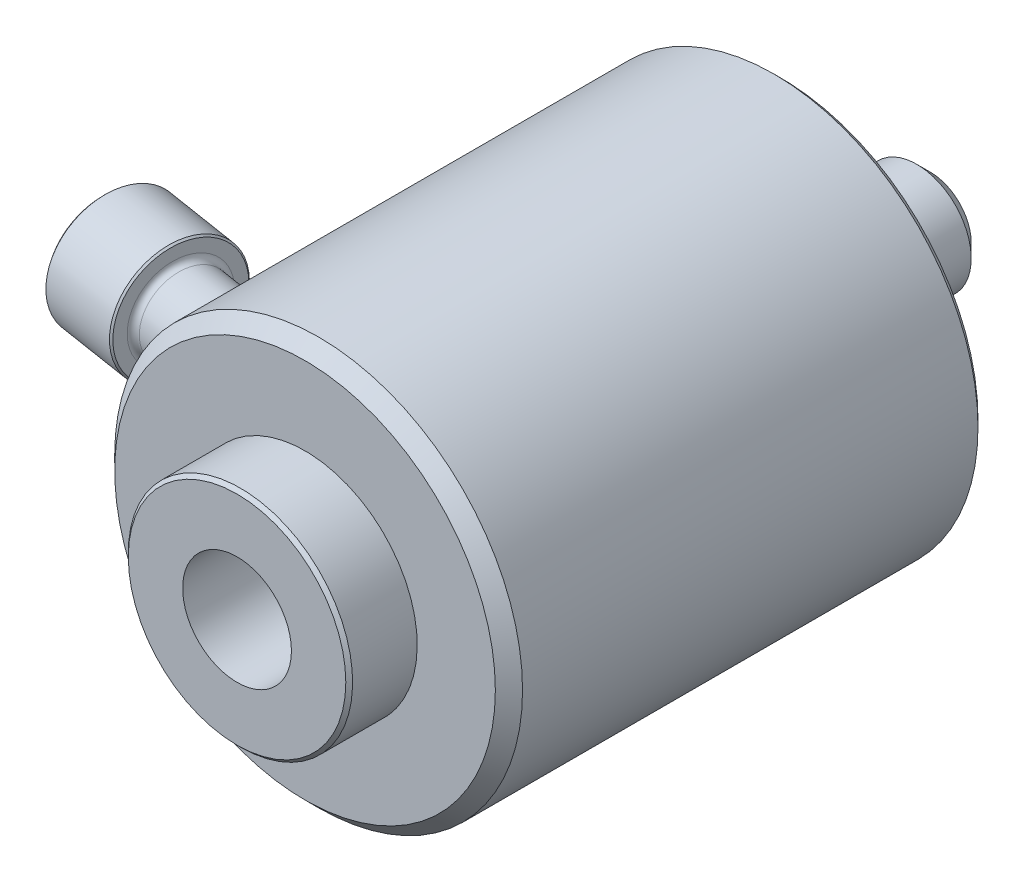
ISO-10303-21;
HEADER;
FILE_DESCRIPTION(('STEP AP214'),'2;1');
FILE_NAME('part.step','',(''),(''),'','','');
FILE_SCHEMA(('AUTOMOTIVE_DESIGN { 1 0 10303 214 1 1 1 1 }'));
ENDSEC;
DATA;
#1=APPLICATION_CONTEXT('core data for automotive mechanical design processes');
#2=APPLICATION_PROTOCOL_DEFINITION('international standard','automotive_design',2000,#1);
#3=PRODUCT_CONTEXT('',#1,'mechanical');
#4=PRODUCT('Part','Part','',(#3));
#5=PRODUCT_RELATED_PRODUCT_CATEGORY('part','',(#4));
#6=PRODUCT_DEFINITION_FORMATION('','',#4);
#7=PRODUCT_DEFINITION_CONTEXT('part definition',#1,'design');
#8=PRODUCT_DEFINITION('design','',#6,#7);
#9=PRODUCT_DEFINITION_SHAPE('','',#8);
#10=(LENGTH_UNIT() NAMED_UNIT(*) SI_UNIT(.MILLI.,.METRE.));
#11=(NAMED_UNIT(*) PLANE_ANGLE_UNIT() SI_UNIT($,.RADIAN.));
#12=(NAMED_UNIT(*) SI_UNIT($,.STERADIAN.) SOLID_ANGLE_UNIT());
#13=UNCERTAINTY_MEASURE_WITH_UNIT(LENGTH_MEASURE(1.E-05),#10,'distance_accuracy_value','');
#14=(GEOMETRIC_REPRESENTATION_CONTEXT(3) GLOBAL_UNCERTAINTY_ASSIGNED_CONTEXT((#13)) GLOBAL_UNIT_ASSIGNED_CONTEXT((#10,
#11,#12)) REPRESENTATION_CONTEXT('',''));
#15=CARTESIAN_POINT('',(0.,0.,0.));
#16=DIRECTION('',(0.,0.,1.));
#17=DIRECTION('',(1.,0.,0.));
#18=AXIS2_PLACEMENT_3D('',#15,#16,#17);
#19=CARTESIAN_POINT('',(0.,-6.97458720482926,45.));
#20=DIRECTION('',(0.,1.,0.));
#21=DIRECTION('',(0.,0.,1.));
#22=AXIS2_PLACEMENT_3D('',#19,#20,#21);
#23=CYLINDRICAL_SURFACE('',#22,2.5);
#24=CARTESIAN_POINT('',(0.,-27.5,45.));
#25=DIRECTION('',(0.,-1.,0.));
#26=DIRECTION('',(0.,0.,-1.));
#27=AXIS2_PLACEMENT_3D('',#24,#25,#26);
#28=CIRCLE('',#27,2.5);
#29=CARTESIAN_POINT('',(0.,-27.5,42.5));
#30=VERTEX_POINT('',#29);
#31=EDGE_CURVE('P0_E10',#30,#30,#28,.T.);
#32=ORIENTED_EDGE('',*,*,#31,.F.);
#33=EDGE_LOOP('',(#32));
#34=FACE_BOUND('',#33,.T.);
#35=CARTESIAN_POINT('',(0.,-30.,47.5));
#36=CARTESIAN_POINT('',(-0.140165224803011,-29.9999986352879,47.4999938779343));
#37=CARTESIAN_POINT('',(-0.280425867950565,-29.9990072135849,47.4881725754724));
#38=CARTESIAN_POINT('',(-0.557066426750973,-29.9951475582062,47.4411891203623));
#39=CARTESIAN_POINT('',(-0.693441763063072,-29.9922771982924,47.4060005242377));
#40=CARTESIAN_POINT('',(-0.958265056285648,-29.9849840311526,47.3133071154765));
#41=CARTESIAN_POINT('',(-1.08671745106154,-29.9805621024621,47.2558149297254));
#42=CARTESIAN_POINT('',(-1.33211808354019,-29.9706616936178,47.12016892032));
#43=CARTESIAN_POINT('',(-1.44906877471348,-29.9651834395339,47.0420195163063));
#44=CARTESIAN_POINT('',(-1.66847499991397,-29.9537694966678,46.867062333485));
#45=CARTESIAN_POINT('',(-1.77089718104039,-29.9478328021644,46.7702127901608));
#46=CARTESIAN_POINT('',(-1.95805283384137,-29.9361795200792,46.5606927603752));
#47=CARTESIAN_POINT('',(-2.04278552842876,-29.930462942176,46.4480215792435));
#48=CARTESIAN_POINT('',(-2.19226980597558,-29.9198863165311,46.2098547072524));
#49=CARTESIAN_POINT('',(-2.25699208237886,-29.9150275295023,46.0843405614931));
#50=CARTESIAN_POINT('',(-2.36443108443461,-29.9067281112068,45.82417926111));
#51=CARTESIAN_POINT('',(-2.40714819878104,-29.9032874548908,45.6895322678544));
#52=CARTESIAN_POINT('',(-2.46926757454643,-29.898222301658,45.415261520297));
#53=CARTESIAN_POINT('',(-2.48872416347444,-29.8965935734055,45.2756501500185));
#54=CARTESIAN_POINT('',(-2.50393802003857,-29.8953233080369,44.9951344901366));
#55=CARTESIAN_POINT('',(-2.49969573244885,-29.8956817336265,44.8542302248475));
#56=CARTESIAN_POINT('',(-2.46767716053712,-29.8983414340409,44.5755008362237));
#57=CARTESIAN_POINT('',(-2.43995992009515,-29.9006378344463,44.437668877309));
#58=CARTESIAN_POINT('',(-2.36186996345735,-29.9069070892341,44.1686203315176));
#59=CARTESIAN_POINT('',(-2.31149702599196,-29.91087995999,44.0374038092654));
#60=CARTESIAN_POINT('',(-2.18945947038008,-29.9200601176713,43.7851227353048));
#61=CARTESIAN_POINT('',(-2.11776836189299,-29.9252689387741,43.6640710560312));
#62=CARTESIAN_POINT('',(-1.95514860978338,-29.936332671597,43.4356966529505));
#63=CARTESIAN_POINT('',(-1.86421957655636,-29.9421875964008,43.3283742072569));
#64=CARTESIAN_POINT('',(-1.66537395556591,-29.9539055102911,43.1301614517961));
#65=CARTESIAN_POINT('',(-1.55740632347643,-29.9597684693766,43.0393223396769));
#66=CARTESIAN_POINT('',(-1.32772639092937,-29.9708247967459,42.8770506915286));
#67=CARTESIAN_POINT('',(-1.20601408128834,-29.9760181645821,42.8056181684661));
#68=CARTESIAN_POINT('',(-0.952266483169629,-29.985151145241,42.6841905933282));
#69=CARTESIAN_POINT('',(-0.820230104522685,-29.9890906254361,42.6341978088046));
#70=CARTESIAN_POINT('',(-0.549597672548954,-29.9952704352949,42.5571046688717));
#71=CARTESIAN_POINT('',(-0.411001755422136,-29.9975108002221,42.5300038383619));
#72=CARTESIAN_POINT('',(-0.131628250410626,-30.0000354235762,42.4995280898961));
#73=CARTESIAN_POINT('',(0.00914157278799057,-30.0003255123,42.4960824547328));
#74=CARTESIAN_POINT('',(0.289256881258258,-29.9989324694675,42.5128296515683));
#75=CARTESIAN_POINT('',(0.428602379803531,-29.9972493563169,42.5330222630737));
#76=CARTESIAN_POINT('',(0.701711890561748,-29.992102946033,42.5964141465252));
#77=CARTESIAN_POINT('',(0.835483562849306,-29.9886421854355,42.6395806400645));
#78=CARTESIAN_POINT('',(1.09388541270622,-29.9803292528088,42.7476614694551));
#79=CARTESIAN_POINT('',(1.21851544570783,-29.975477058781,42.8125761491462));
#80=CARTESIAN_POINT('',(1.45541804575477,-29.9649106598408,42.9624883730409));
#81=CARTESIAN_POINT('',(1.56766087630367,-29.9591944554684,43.0475327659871));
#82=CARTESIAN_POINT('',(1.77630273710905,-29.9475489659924,43.2352226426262));
#83=CARTESIAN_POINT('',(1.87270149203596,-29.9416196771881,43.3378684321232));
#84=CARTESIAN_POINT('',(2.04716136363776,-29.9301990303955,43.5581542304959));
#85=CARTESIAN_POINT('',(2.12517633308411,-29.9247087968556,43.6758308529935));
#86=CARTESIAN_POINT('',(2.2603376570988,-29.914803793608,43.9226556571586));
#87=CARTESIAN_POINT('',(2.31748422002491,-29.9103890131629,44.0518037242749));
#88=CARTESIAN_POINT('',(2.40920794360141,-29.9031410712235,44.3177419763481));
#89=CARTESIAN_POINT('',(2.44381335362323,-29.9003059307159,44.4545223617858));
#90=CARTESIAN_POINT('',(2.48956442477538,-29.8965316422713,44.7319767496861));
#91=CARTESIAN_POINT('',(2.50071053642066,-29.8955924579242,44.872650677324));
#92=CARTESIAN_POINT('',(2.49922140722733,-29.8957169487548,45.1534403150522));
#93=CARTESIAN_POINT('',(2.48665867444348,-29.8967745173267,45.2935564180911));
#94=CARTESIAN_POINT('',(2.43825965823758,-29.9007603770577,45.5696813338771));
#95=CARTESIAN_POINT('',(2.40242333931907,-29.9036886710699,45.7056901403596));
#96=CARTESIAN_POINT('',(2.30851277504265,-29.9110844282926,45.9697444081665));
#97=CARTESIAN_POINT('',(2.25043983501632,-29.9155518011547,46.0977903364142));
#98=CARTESIAN_POINT('',(2.11371264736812,-29.9255224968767,46.3423271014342));
#99=CARTESIAN_POINT('',(2.03505872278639,-29.9310258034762,46.4588181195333));
#100=CARTESIAN_POINT('',(1.85912985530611,-29.942468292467,46.6773093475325));
#101=CARTESIAN_POINT('',(1.76180123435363,-29.9484087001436,46.7792662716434));
#102=CARTESIAN_POINT('',(1.55138306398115,-29.960044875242,46.9654379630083));
#103=CARTESIAN_POINT('',(1.43828970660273,-29.9657405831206,47.0496484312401));
#104=CARTESIAN_POINT('',(1.19933443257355,-29.9762558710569,47.1980496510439));
#105=CARTESIAN_POINT('',(1.07344914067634,-29.9810738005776,47.2622028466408));
#106=CARTESIAN_POINT('',(0.812739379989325,-29.9892713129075,47.3683795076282));
#107=CARTESIAN_POINT('',(0.677925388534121,-29.9926525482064,47.4104284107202));
#108=CARTESIAN_POINT('',(0.451930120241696,-29.9967276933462,47.4604939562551));
#109=CARTESIAN_POINT('',(0.362202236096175,-29.9979492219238,47.4752890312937));
#110=CARTESIAN_POINT('',(0.181662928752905,-29.9995858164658,47.495044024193));
#111=CARTESIAN_POINT('',(0.0908515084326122,-30.0000008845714,47.5000039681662));
#112=CARTESIAN_POINT('',(0.,-30.,47.5));
#113=B_SPLINE_CURVE_WITH_KNOTS('',3,(#35,#36,#37,#38,#39,#40,#41,#42,#43,#44,#45,#46,#47,#48,
#49,#50,#51,#52,#53,#54,#55,#56,#57,#58,#59,#60,#61,#62,#63,#64,#65,#66,#67,#68,#69,#70,#71,#72,
#73,#74,#75,#76,#77,#78,#79,#80,#81,#82,#83,#84,#85,#86,#87,#88,#89,#90,#91,#92,#93,#94,#95,#96,
#97,#98,#99,#100,#101,#102,#103,#104,#105,#106,#107,#108,#109,#110,#111,#112),.UNSPECIFIED.,.T.,
.F.,(4,2,2,2,2,2,2,2,2,2,2,2,2,2,2,2,2,2,2,2,2,2,2,2,2,2,2,2,2,2,2,2,2,2,2,2,2,2,4),(0.,
0.420163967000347,0.840804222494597,1.26120668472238,1.68151927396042,2.10278167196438,
2.52406257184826,2.94595757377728,3.36784512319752,3.78874537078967,4.20963771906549,
4.62947457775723,5.04931553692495,5.46968039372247,5.89005376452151,6.31171127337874,
6.73336906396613,7.15507143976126,7.57676506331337,7.99719748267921,8.41762598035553,
8.83745622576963,9.25729310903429,9.67811687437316,10.0989479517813,10.5208244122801,
10.9426966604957,11.3640391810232,11.7853736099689,12.2054215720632,12.6254701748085,
13.0454941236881,13.4655114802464,13.886754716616,14.308099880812,14.7302293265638,
15.1518719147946,15.4242121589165,15.6965516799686),.UNSPECIFIED.);
#114=CARTESIAN_POINT('',(0.,-30.,47.5));
#115=VERTEX_POINT('',#114);
#116=EDGE_CURVE('P0_E401',#115,#115,#113,.T.);
#117=ORIENTED_EDGE('',*,*,#116,.T.);
#118=EDGE_LOOP('',(#117));
#119=FACE_BOUND('',#118,.T.);
#120=ADVANCED_FACE('P0_F15',(#34,#119),#23,.F.);
#121=CARTESIAN_POINT('',(-11.8292635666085,0.,49.8779619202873));
#122=DIRECTION('',(0.987688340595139,0.,0.156434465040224));
#123=DIRECTION('',(0.156434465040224,0.,-0.987688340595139));
#124=AXIS2_PLACEMENT_3D('',#121,#122,#123);
#125=CYLINDRICAL_SURFACE('',#124,6.);
#126=CARTESIAN_POINT('',(-16.5,0.,43.0633991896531));
#127=CARTESIAN_POINT('',(-16.5000003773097,-0.156454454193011,43.0633985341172));
#128=CARTESIAN_POINT('',(-16.4977695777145,-0.312901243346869,43.0699544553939));
#129=CARTESIAN_POINT('',(-16.4889100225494,-0.624632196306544,43.0960906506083));
#130=CARTESIAN_POINT('',(-16.4822797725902,-0.779915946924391,43.1156753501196));
#131=CARTESIAN_POINT('',(-16.4648105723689,-1.08803421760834,43.1676028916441));
#132=CARTESIAN_POINT('',(-16.453973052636,-1.240869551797,43.1999413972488));
#133=CARTESIAN_POINT('',(-16.4283844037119,-1.5431146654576,43.2769777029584));
#134=CARTESIAN_POINT('',(-16.4136316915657,-1.69252303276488,43.3216805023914));
#135=CARTESIAN_POINT('',(-16.3806667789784,-1.98633387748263,43.4227285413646));
#136=CARTESIAN_POINT('',(-16.3624674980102,-2.1307527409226,43.4790303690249));
#137=CARTESIAN_POINT('',(-16.3230371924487,-2.41433066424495,43.6027694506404));
#138=CARTESIAN_POINT('',(-16.3018050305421,-2.55348772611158,43.6702108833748));
#139=CARTESIAN_POINT('',(-16.2343252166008,-2.96185830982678,43.8882617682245));
#140=CARTESIAN_POINT('',(-16.1842686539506,-3.22218868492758,44.0546736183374));
#141=CARTESIAN_POINT('',(-16.0753190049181,-3.72901739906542,44.4353751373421));
#142=CARTESIAN_POINT('',(-16.0160723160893,-3.97368924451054,44.6519746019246));
#143=CARTESIAN_POINT('',(-15.8968650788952,-4.42657425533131,45.1203039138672));
#144=CARTESIAN_POINT('',(-15.8369041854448,-4.63476896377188,45.3720514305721));
#145=CARTESIAN_POINT('',(-15.7163077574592,-5.02935018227,45.9310343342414));
#146=CARTESIAN_POINT('',(-15.6561691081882,-5.21167287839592,46.2412822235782));
#147=CARTESIAN_POINT('',(-15.5758344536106,-5.44519300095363,46.7271484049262));
#148=CARTESIAN_POINT('',(-15.5506891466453,-5.51640442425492,46.8926295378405));
#149=CARTESIAN_POINT('',(-15.5045060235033,-5.64490611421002,47.2294415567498));
#150=CARTESIAN_POINT('',(-15.4834663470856,-5.70220268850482,47.4007697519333));
#151=CARTESIAN_POINT('',(-15.4462489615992,-5.80226213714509,47.7481573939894));
#152=CARTESIAN_POINT('',(-15.430071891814,-5.84502310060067,47.9242174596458));
#153=CARTESIAN_POINT('',(-15.4032307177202,-5.91539569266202,48.2796864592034));
#154=CARTESIAN_POINT('',(-15.392564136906,-5.94301412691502,48.4590938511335));
#155=CARTESIAN_POINT('',(-15.3772222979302,-5.98259876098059,48.8198123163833));
#156=CARTESIAN_POINT('',(-15.3725444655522,-5.99457168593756,49.0011225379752));
#157=CARTESIAN_POINT('',(-15.369453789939,-6.00249225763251,49.3641441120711));
#158=CARTESIAN_POINT('',(-15.3710403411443,-5.99844145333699,49.5458554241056));
#159=CARTESIAN_POINT('',(-15.3801074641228,-5.97515081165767,49.892445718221));
#160=CARTESIAN_POINT('',(-15.3870697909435,-5.95724622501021,50.0574292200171));
#161=CARTESIAN_POINT('',(-15.4060979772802,-5.90786307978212,50.3850512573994));
#162=CARTESIAN_POINT('',(-15.4181635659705,-5.87638524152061,50.5476899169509));
#163=CARTESIAN_POINT('',(-15.4470583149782,-5.80000453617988,50.8693269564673));
#164=CARTESIAN_POINT('',(-15.463886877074,-5.75510335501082,51.0283257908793));
#165=CARTESIAN_POINT('',(-15.5018062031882,-5.65216853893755,51.3414885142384));
#166=CARTESIAN_POINT('',(-15.5228969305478,-5.59413501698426,51.4956524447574));
#167=CARTESIAN_POINT('',(-15.5676827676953,-5.4682274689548,51.7912967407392));
#168=CARTESIAN_POINT('',(-15.591220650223,-5.40090481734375,51.9330363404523));
#169=CARTESIAN_POINT('',(-15.6409658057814,-5.25510424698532,52.2102254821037));
#170=CARTESIAN_POINT('',(-15.6671739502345,-5.17662268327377,52.3456729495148));
#171=CARTESIAN_POINT('',(-15.7215409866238,-5.00908174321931,52.6093942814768));
#172=CARTESIAN_POINT('',(-15.7496994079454,-4.92002491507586,52.7376698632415));
#173=CARTESIAN_POINT('',(-15.8072454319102,-4.73187812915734,52.986418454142));
#174=CARTESIAN_POINT('',(-15.8366334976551,-4.63278437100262,53.1068884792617));
#175=CARTESIAN_POINT('',(-15.8968785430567,-4.42172978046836,53.3432576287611));
#176=CARTESIAN_POINT('',(-15.9277516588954,-4.30944798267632,53.4588661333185));
#177=CARTESIAN_POINT('',(-15.9891933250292,-4.07557574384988,53.6804262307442));
#178=CARTESIAN_POINT('',(-16.0197617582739,-3.95398187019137,53.786374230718));
#179=CARTESIAN_POINT('',(-16.0797850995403,-3.70232869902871,53.9879824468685));
#180=CARTESIAN_POINT('',(-16.1092402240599,-3.5722710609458,54.0836446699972));
#181=CARTESIAN_POINT('',(-16.1663042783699,-3.30444523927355,54.2642253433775));
#182=CARTESIAN_POINT('',(-16.1939125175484,-3.1666742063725,54.3491397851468));
#183=CARTESIAN_POINT('',(-16.247461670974,-2.87958610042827,54.5103847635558));
#184=CARTESIAN_POINT('',(-16.2733153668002,-2.73003660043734,54.5863309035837));
#185=CARTESIAN_POINT('',(-16.3216125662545,-2.42463827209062,54.7257655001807));
#186=CARTESIAN_POINT('',(-16.3440547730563,-2.26878707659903,54.7892492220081));
#187=CARTESIAN_POINT('',(-16.3849087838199,-1.95198826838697,54.9032941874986));
#188=CARTESIAN_POINT('',(-16.4033223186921,-1.79104287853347,54.9538609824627));
#189=CARTESIAN_POINT('',(-16.4356437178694,-1.46507592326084,55.0417855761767));
#190=CARTESIAN_POINT('',(-16.4495499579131,-1.30005291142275,55.079138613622));
#191=CARTESIAN_POINT('',(-16.4723665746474,-0.968738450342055,55.140065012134));
#192=CARTESIAN_POINT('',(-16.4813222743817,-0.802473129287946,55.1637634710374));
#193=CARTESIAN_POINT('',(-16.4941978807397,-0.468381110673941,55.1977495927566));
#194=CARTESIAN_POINT('',(-16.4981177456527,-0.300554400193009,55.2080371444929));
#195=CARTESIAN_POINT('',(-16.5008170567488,0.0354093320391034,55.2151268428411));
#196=CARTESIAN_POINT('',(-16.4995969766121,0.203546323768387,55.2119302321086));
#197=CARTESIAN_POINT('',(-16.4920498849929,0.538907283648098,55.1920773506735));
#198=CARTESIAN_POINT('',(-16.4857229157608,0.70613125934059,55.1754211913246));
#199=CARTESIAN_POINT('',(-16.4682735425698,1.03574262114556,55.1291476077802));
#200=CARTESIAN_POINT('',(-16.457230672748,1.19816445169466,55.0997450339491));
#201=CARTESIAN_POINT('',(-16.4306490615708,1.51980658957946,55.0282278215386));
#202=CARTESIAN_POINT('',(-16.4151103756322,1.67902693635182,54.9861133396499));
#203=CARTESIAN_POINT('',(-16.379929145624,1.99321799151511,54.8894338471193));
#204=CARTESIAN_POINT('',(-16.3602855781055,2.14818762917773,54.8348657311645));
#205=CARTESIAN_POINT('',(-16.3174039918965,2.45274753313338,54.7136458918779));
#206=CARTESIAN_POINT('',(-16.2941671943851,2.60233960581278,54.646998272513));
#207=CARTESIAN_POINT('',(-16.2443832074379,2.89700044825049,54.5011223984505));
#208=CARTESIAN_POINT('',(-16.2177992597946,3.04199227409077,54.4217512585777));
#209=CARTESIAN_POINT('',(-16.1622505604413,3.32451176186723,54.2515169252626));
#210=CARTESIAN_POINT('',(-16.1332866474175,3.46204202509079,54.1606577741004));
#211=CARTESIAN_POINT('',(-16.07371410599,3.72886212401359,53.9678861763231));
#212=CARTESIAN_POINT('',(-16.043104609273,3.85814752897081,53.8659678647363));
#213=CARTESIAN_POINT('',(-15.9810824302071,4.1074939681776,53.6517233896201));
#214=CARTESIAN_POINT('',(-15.9496700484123,4.2275583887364,53.5394010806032));
#215=CARTESIAN_POINT('',(-15.8863846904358,4.4595367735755,53.3030724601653));
#216=CARTESIAN_POINT('',(-15.8545123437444,4.57129053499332,53.1789085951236));
#217=CARTESIAN_POINT('',(-15.7917392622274,4.78364181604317,52.9212340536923));
#218=CARTESIAN_POINT('',(-15.7608381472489,4.8842437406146,52.7877271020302));
#219=CARTESIAN_POINT('',(-15.7009046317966,5.07360449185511,52.5121213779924));
#220=CARTESIAN_POINT('',(-15.6718726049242,5.16236095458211,52.3700208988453));
#221=CARTESIAN_POINT('',(-15.6165835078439,5.32727746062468,52.0782528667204));
#222=CARTESIAN_POINT('',(-15.5903252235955,5.40344302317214,51.9285886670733));
#223=CARTESIAN_POINT('',(-15.5420252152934,5.54081390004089,51.6266607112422));
#224=CARTESIAN_POINT('',(-15.5198919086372,5.60235554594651,51.4745646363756));
#225=CARTESIAN_POINT('',(-15.4796984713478,5.7124752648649,51.1652941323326));
#226=CARTESIAN_POINT('',(-15.4616366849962,5.76105860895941,51.0081217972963));
#227=CARTESIAN_POINT('',(-15.4301159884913,5.84495779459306,50.6898389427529));
#228=CARTESIAN_POINT('',(-15.4166566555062,5.88027485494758,50.5287287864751));
#229=CARTESIAN_POINT('',(-15.3947234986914,5.9374598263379,50.2038079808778));
#230=CARTESIAN_POINT('',(-15.3862495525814,5.95932806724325,50.0399973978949));
#231=CARTESIAN_POINT('',(-15.3747319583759,5.98897796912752,49.7175437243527));
#232=CARTESIAN_POINT('',(-15.3714846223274,5.99728819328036,49.5589560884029));
#233=CARTESIAN_POINT('',(-15.3698068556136,6.00158668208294,49.2415384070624));
#234=CARTESIAN_POINT('',(-15.3713780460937,5.99757079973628,49.0827082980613));
#235=CARTESIAN_POINT('',(-15.3792244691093,5.97742168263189,48.7659798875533));
#236=CARTESIAN_POINT('',(-15.38549857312,5.9612913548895,48.6080813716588));
#237=CARTESIAN_POINT('',(-15.4025049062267,5.91721199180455,48.2941340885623));
#238=CARTESIAN_POINT('',(-15.4132388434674,5.88925842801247,48.1380860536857));
#239=CARTESIAN_POINT('',(-15.4391595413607,5.82097278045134,47.8246030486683));
#240=CARTESIAN_POINT('',(-15.454459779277,5.7803238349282,47.6672463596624));
#241=CARTESIAN_POINT('',(-15.4889065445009,5.68737342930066,47.3564247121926));
#242=CARTESIAN_POINT('',(-15.5080544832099,5.63506769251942,47.202961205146));
#243=CARTESIAN_POINT('',(-15.5704587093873,5.46132336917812,46.7497089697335));
#244=CARTESIAN_POINT('',(-15.6186910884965,5.32301846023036,46.4568809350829));
#245=CARTESIAN_POINT('',(-15.7279574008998,4.99142923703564,45.8719778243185));
#246=CARTESIAN_POINT('',(-15.7897389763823,4.79441570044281,45.5821727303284));
#247=CARTESIAN_POINT('',(-15.9163178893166,4.35577325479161,45.0387370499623));
#248=CARTESIAN_POINT('',(-15.9811166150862,4.11412365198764,44.7851233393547));
#249=CARTESIAN_POINT('',(-16.0764933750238,3.71697967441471,44.4331786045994));
#250=CARTESIAN_POINT('',(-16.1085658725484,3.57581645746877,44.3187502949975));
#251=CARTESIAN_POINT('',(-16.1706693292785,3.28355485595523,44.1027829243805));
#252=CARTESIAN_POINT('',(-16.2007011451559,3.13246069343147,44.0012384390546));
#253=CARTESIAN_POINT('',(-16.2577808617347,2.8212730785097,43.8121571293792));
#254=CARTESIAN_POINT('',(-16.2848296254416,2.66118224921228,43.7246162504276));
#255=CARTESIAN_POINT('',(-16.3350661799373,2.33305419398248,43.5646028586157));
#256=CARTESIAN_POINT('',(-16.3582543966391,2.16501784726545,43.4921286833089));
#257=CARTESIAN_POINT('',(-16.3983852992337,1.83532294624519,43.3681739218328));
#258=CARTESIAN_POINT('',(-16.4156683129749,1.67414746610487,43.3155178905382));
#259=CARTESIAN_POINT('',(-16.445714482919,1.34736221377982,43.2246796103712));
#260=CARTESIAN_POINT('',(-16.4584781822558,1.18175297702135,43.1864956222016));
#261=CARTESIAN_POINT('',(-16.4790668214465,0.847564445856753,43.1251824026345));
#262=CARTESIAN_POINT('',(-16.4868946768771,0.678986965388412,43.1020442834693));
#263=CARTESIAN_POINT('',(-16.4973608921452,0.340269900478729,43.0711535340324));
#264=CARTESIAN_POINT('',(-16.499999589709,0.170130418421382,43.0633999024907));
#265=CARTESIAN_POINT('',(-16.5,0.,43.0633991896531));
#266=B_SPLINE_CURVE_WITH_KNOTS('',3,(#126,#127,#128,#129,#130,#131,#132,#133,#134,#135,#136,
#137,#138,#139,#140,#141,#142,#143,#144,#145,#146,#147,#148,#149,#150,#151,#152,#153,#154,#155,
#156,#157,#158,#159,#160,#161,#162,#163,#164,#165,#166,#167,#168,#169,#170,#171,#172,#173,#174,
#175,#176,#177,#178,#179,#180,#181,#182,#183,#184,#185,#186,#187,#188,#189,#190,#191,#192,#193,
#194,#195,#196,#197,#198,#199,#200,#201,#202,#203,#204,#205,#206,#207,#208,#209,#210,#211,#212,
#213,#214,#215,#216,#217,#218,#219,#220,#221,#222,#223,#224,#225,#226,#227,#228,#229,#230,#231,
#232,#233,#234,#235,#236,#237,#238,#239,#240,#241,#242,#243,#244,#245,#246,#247,#248,#249,#250,
#251,#252,#253,#254,#255,#256,#257,#258,#259,#260,#261,#262,#263,#264,#265),.UNSPECIFIED.,.T.,
.F.,(4,2,2,2,2,2,2,2,2,2,2,2,2,2,2,2,2,2,2,2,2,2,2,2,2,2,2,2,2,2,2,2,2,2,2,2,2,2,2,2,2,2,2,2,2,
2,2,2,2,2,2,2,2,2,2,2,2,2,2,2,2,2,2,2,2,2,2,2,2,4),(0.,0.469197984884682,0.938555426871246,
1.40775342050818,1.87714140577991,2.34480352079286,2.81264146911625,3.74763022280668,
4.73994091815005,5.73275226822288,6.8216988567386,7.36685506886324,7.91176369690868,
8.45674393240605,9.00147903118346,9.54597990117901,10.0904281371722,10.5880869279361,
11.0857193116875,11.5832892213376,12.0808548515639,12.5563268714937,13.0319545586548,
13.5074678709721,13.9831619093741,14.4748779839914,14.966776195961,15.4585782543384,
15.9505631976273,16.459082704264,16.9677950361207,17.4762883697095,17.9849647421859,
18.4889035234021,18.992846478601,19.4967429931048,20.0006353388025,20.4963457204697,
20.9920499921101,21.4878780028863,21.98353787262,22.4852140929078,22.9867142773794,
23.4884817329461,23.9900640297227,24.4996322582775,25.0089984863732,25.518466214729,
26.027710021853,26.5237665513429,27.0196209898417,27.5154298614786,28.0112265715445,
28.4871878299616,28.9633092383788,29.4393164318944,29.9155061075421,30.4046853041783,
30.8940442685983,31.8722204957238,32.9352718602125,33.9988173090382,34.5517909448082,
35.1045309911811,35.6571107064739,36.2096294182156,36.7202372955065,37.2307837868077,
37.7410284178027,38.2512398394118),.UNSPECIFIED.);
#267=CARTESIAN_POINT('',(-16.5,0.,43.0633991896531));
#268=VERTEX_POINT('',#267);
#269=EDGE_CURVE('P0_E345',#268,#268,#266,.T.);
#270=ORIENTED_EDGE('',*,*,#269,.F.);
#271=EDGE_LOOP('',(#270));
#272=FACE_BOUND('',#271,.T.);
#273=CARTESIAN_POINT('',(-17.4612507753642,0.,48.9859427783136));
#274=DIRECTION('',(0.987688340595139,0.,0.156434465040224));
#275=DIRECTION('',(0.156434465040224,0.,-0.987688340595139));
#276=AXIS2_PLACEMENT_3D('',#273,#274,#275);
#277=CIRCLE('',#276,6.);
#278=CARTESIAN_POINT('',(-16.5226439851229,0.,43.0598127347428));
#279=VERTEX_POINT('',#278);
#280=EDGE_CURVE('P0_E299',#279,#279,#277,.T.);
#281=ORIENTED_EDGE('',*,*,#280,.F.);
#282=EDGE_LOOP('',(#281));
#283=FACE_BOUND('',#282,.T.);
#284=ADVANCED_FACE('P0_F364',(#272,#283),#125,.F.);
#285=CARTESIAN_POINT('',(0.,0.,70.));
#286=DIRECTION('',(0.,0.,-1.));
#287=DIRECTION('',(-1.,0.,0.));
#288=AXIS2_PLACEMENT_3D('',#285,#286,#287);
#289=CYLINDRICAL_SURFACE('',#288,30.);
#290=CARTESIAN_POINT('',(0.,0.,0.999999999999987));
#291=DIRECTION('',(0.,0.,1.));
#292=DIRECTION('',(1.,0.,0.));
#293=AXIS2_PLACEMENT_3D('',#290,#291,#292);
#294=CIRCLE('',#293,30.);
#295=CARTESIAN_POINT('',(30.,0.,0.999999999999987));
#296=VERTEX_POINT('',#295);
#297=EDGE_CURVE('P0_E439',#296,#296,#294,.T.);
#298=ORIENTED_EDGE('',*,*,#297,.T.);
#299=EDGE_LOOP('',(#298));
#300=FACE_BOUND('',#299,.T.);
#301=CARTESIAN_POINT('',(0.,0.,68.));
#302=DIRECTION('',(0.,0.,1.));
#303=DIRECTION('',(1.,0.,0.));
#304=AXIS2_PLACEMENT_3D('',#301,#302,#303);
#305=CIRCLE('',#304,30.);
#306=CARTESIAN_POINT('',(30.,0.,68.));
#307=VERTEX_POINT('',#306);
#308=EDGE_CURVE('P0_E434',#307,#307,#305,.F.);
#309=ORIENTED_EDGE('',*,*,#308,.T.);
#310=EDGE_LOOP('',(#309));
#311=FACE_BOUND('',#310,.T.);
#312=ORIENTED_EDGE('',*,*,#116,.F.);
#313=EDGE_LOOP('',(#312));
#314=FACE_BOUND('',#313,.T.);
#315=CARTESIAN_POINT('',(-30.,0.,53.074790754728));
#316=CARTESIAN_POINT('',(-30.0000016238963,0.168595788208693,53.0747935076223));
#317=CARTESIAN_POINT('',(-29.9985763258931,0.337151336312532,53.0678200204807));
#318=CARTESIAN_POINT('',(-29.9929177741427,0.673113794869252,53.0399755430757));
#319=CARTESIAN_POINT('',(-29.9886840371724,0.840520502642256,53.0191021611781));
#320=CARTESIAN_POINT('',(-29.9775199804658,1.17302754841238,52.9635728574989));
#321=CARTESIAN_POINT('',(-29.9705882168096,1.33812660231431,52.928909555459));
#322=CARTESIAN_POINT('',(-29.9542172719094,1.66481980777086,52.8460111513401));
#323=CARTESIAN_POINT('',(-29.9447771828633,1.82641266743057,52.7977711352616));
#324=CARTESIAN_POINT('',(-29.9236596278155,2.14476774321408,52.6880762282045));
#325=CARTESIAN_POINT('',(-29.9119837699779,2.30153333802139,52.6266308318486));
#326=CARTESIAN_POINT('',(-29.8867093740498,2.60930144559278,52.4908770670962));
#327=CARTESIAN_POINT('',(-29.8731101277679,2.76030180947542,52.4165639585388));
#328=CARTESIAN_POINT('',(-29.8443781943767,3.0553313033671,52.2556132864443));
#329=CARTESIAN_POINT('',(-29.8292462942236,3.19936395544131,52.1689820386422));
#330=CARTESIAN_POINT('',(-29.7978603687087,3.47956941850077,51.9838961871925));
#331=CARTESIAN_POINT('',(-29.7816059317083,3.61573931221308,51.8854372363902));
#332=CARTESIAN_POINT('',(-29.7484430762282,3.87914328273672,51.6774056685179));
#333=CARTESIAN_POINT('',(-29.7315348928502,4.00638052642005,51.5678370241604));
#334=CARTESIAN_POINT('',(-29.6975312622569,4.25110673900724,51.3382433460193));
#335=CARTESIAN_POINT('',(-29.6804357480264,4.36859208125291,51.2182144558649));
#336=CARTESIAN_POINT('',(-29.6465578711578,4.59287142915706,50.9685977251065));
#337=CARTESIAN_POINT('',(-29.6297753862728,4.69966968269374,50.8390137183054));
#338=CARTESIAN_POINT('',(-29.5969916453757,4.9018961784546,50.571088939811));
#339=CARTESIAN_POINT('',(-29.5809906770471,4.99732025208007,50.4327449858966));
#340=CARTESIAN_POINT('',(-29.5503484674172,5.17542428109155,50.14934055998));
#341=CARTESIAN_POINT('',(-29.5356982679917,5.25819102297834,50.0043355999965));
#342=CARTESIAN_POINT('',(-29.5080400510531,5.41124969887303,49.7076693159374));
#343=CARTESIAN_POINT('',(-29.4950326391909,5.48153703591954,49.5560055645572));
#344=CARTESIAN_POINT('',(-29.4710410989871,5.60909630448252,49.2472130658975));
#345=CARTESIAN_POINT('',(-29.4600560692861,5.66637403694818,49.090086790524));
#346=CARTESIAN_POINT('',(-29.4404025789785,5.76760912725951,48.771442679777));
#347=CARTESIAN_POINT('',(-29.4317349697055,5.81156159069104,48.6099232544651));
#348=CARTESIAN_POINT('',(-29.4097090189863,5.92241382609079,48.1229771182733));
#349=CARTESIAN_POINT('',(-29.4001214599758,5.96936735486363,47.7925830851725));
#350=CARTESIAN_POINT('',(-29.3920530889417,6.0089552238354,47.1286679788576));
#351=CARTESIAN_POINT('',(-29.3935729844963,6.0015861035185,46.7951467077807));
#352=CARTESIAN_POINT('',(-29.4074656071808,5.93314731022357,46.1293097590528));
#353=CARTESIAN_POINT('',(-29.4199798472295,5.87137739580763,45.7970667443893));
#354=CARTESIAN_POINT('',(-29.4458438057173,5.73969875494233,45.3099714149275));
#355=CARTESIAN_POINT('',(-29.4556550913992,5.68926071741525,45.1493933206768));
#356=CARTESIAN_POINT('',(-29.477352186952,5.57575828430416,44.8329210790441));
#357=CARTESIAN_POINT('',(-29.4892373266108,5.51269796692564,44.6770254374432));
#358=CARTESIAN_POINT('',(-29.5151831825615,5.37207879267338,44.3657890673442));
#359=CARTESIAN_POINT('',(-29.5293032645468,5.29410632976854,44.2106404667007));
#360=CARTESIAN_POINT('',(-29.5589988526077,5.12570906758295,43.9074686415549));
#361=CARTESIAN_POINT('',(-29.5745738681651,5.03528846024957,43.7594430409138));
#362=CARTESIAN_POINT('',(-29.6067511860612,4.84250303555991,43.471386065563));
#363=CARTESIAN_POINT('',(-29.6233540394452,4.7401317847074,43.3313590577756));
#364=CARTESIAN_POINT('',(-29.657106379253,4.52415515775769,43.0604099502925));
#365=CARTESIAN_POINT('',(-29.6742556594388,4.41055398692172,42.9294844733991));
#366=CARTESIAN_POINT('',(-29.7089347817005,4.17062877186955,42.6753633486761));
#367=CARTESIAN_POINT('',(-29.7264659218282,4.04411267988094,42.5523490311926));
#368=CARTESIAN_POINT('',(-29.7610811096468,3.78095908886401,42.3177056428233));
#369=CARTESIAN_POINT('',(-29.7781653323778,3.64432563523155,42.206072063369));
#370=CARTESIAN_POINT('',(-29.8113907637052,3.36172919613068,41.9950520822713));
#371=CARTESIAN_POINT('',(-29.827531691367,3.21576345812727,41.8956693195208));
#372=CARTESIAN_POINT('',(-29.8583674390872,2.91558590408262,41.7101418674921));
#373=CARTESIAN_POINT('',(-29.8730629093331,2.76137784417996,41.6239912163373));
#374=CARTESIAN_POINT('',(-29.9001540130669,2.45039349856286,41.4680523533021));
#375=CARTESIAN_POINT('',(-29.9126045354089,2.29382581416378,41.3978577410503));
#376=CARTESIAN_POINT('',(-29.935340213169,1.97507444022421,41.2714170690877));
#377=CARTESIAN_POINT('',(-29.9456263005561,1.81289320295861,41.2151650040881));
#378=CARTESIAN_POINT('',(-29.9637212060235,1.48408744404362,41.1171739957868));
#379=CARTESIAN_POINT('',(-29.971530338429,1.31746348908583,41.0754332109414));
#380=CARTESIAN_POINT('',(-29.9844266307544,0.981062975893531,41.0069220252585));
#381=CARTESIAN_POINT('',(-29.9895139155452,0.811286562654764,40.9801509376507));
#382=CARTESIAN_POINT('',(-29.9966064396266,0.479236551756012,40.9429252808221));
#383=CARTESIAN_POINT('',(-29.9987640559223,0.31705622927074,40.9316635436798));
#384=CARTESIAN_POINT('',(-30.0004386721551,-0.0077473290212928,40.9229179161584));
#385=CARTESIAN_POINT('',(-29.9999547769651,-0.170370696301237,40.9254386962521));
#386=CARTESIAN_POINT('',(-29.9963590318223,-0.494707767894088,40.9442381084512));
#387=CARTESIAN_POINT('',(-29.9932484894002,-0.656421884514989,40.9605098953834));
#388=CARTESIAN_POINT('',(-29.9844892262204,-0.977890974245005,41.0066400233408));
#389=CARTESIAN_POINT('',(-29.9788395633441,-1.13764519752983,41.0365034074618));
#390=CARTESIAN_POINT('',(-29.9653096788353,-1.45059414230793,41.1087295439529));
#391=CARTESIAN_POINT('',(-29.9574797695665,-1.60385607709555,41.1508111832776));
#392=CARTESIAN_POINT('',(-29.9397509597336,-1.90637909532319,41.2473127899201));
#393=CARTESIAN_POINT('',(-29.9298513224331,-2.05563873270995,41.3017371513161));
#394=CARTESIAN_POINT('',(-29.9082483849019,-2.34911136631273,41.4224098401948));
#395=CARTESIAN_POINT('',(-29.8965455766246,-2.49332572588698,41.4886549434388));
#396=CARTESIAN_POINT('',(-29.8716307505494,-2.77593404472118,41.6324438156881));
#397=CARTESIAN_POINT('',(-29.8584181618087,-2.91432577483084,41.7099918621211));
#398=CARTESIAN_POINT('',(-29.8303725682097,-3.18881116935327,41.8784346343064));
#399=CARTESIAN_POINT('',(-29.8155009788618,-3.32468578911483,41.9696798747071));
#400=CARTESIAN_POINT('',(-29.7848905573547,-3.5885861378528,42.162847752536));
#401=CARTESIAN_POINT('',(-29.7691514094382,-3.71660897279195,42.2647742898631));
#402=CARTESIAN_POINT('',(-29.7372165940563,-3.96402687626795,42.4785120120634));
#403=CARTESIAN_POINT('',(-29.7210209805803,-4.08342295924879,42.5903220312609));
#404=CARTESIAN_POINT('',(-29.688575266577,-4.31299733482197,42.82310098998));
#405=CARTESIAN_POINT('',(-29.6723251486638,-4.42317232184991,42.9440731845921));
#406=CARTESIAN_POINT('',(-29.6393331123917,-4.6392349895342,43.200970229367));
#407=CARTESIAN_POINT('',(-29.6226105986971,-4.74458825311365,43.3373474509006));
#408=CARTESIAN_POINT('',(-29.5900262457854,-4.94373657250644,43.6183932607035));
#409=CARTESIAN_POINT('',(-29.5741644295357,-5.03753131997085,43.7630620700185));
#410=CARTESIAN_POINT('',(-29.5437388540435,-5.21300580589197,44.0597674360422));
#411=CARTESIAN_POINT('',(-29.5291755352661,-5.29468143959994,44.2118064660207));
#412=CARTESIAN_POINT('',(-29.5017702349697,-5.44531118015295,44.5221447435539));
#413=CARTESIAN_POINT('',(-29.4889276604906,-5.51426967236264,44.6804418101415));
#414=CARTESIAN_POINT('',(-29.4650451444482,-5.64050926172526,45.0061844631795));
#415=CARTESIAN_POINT('',(-29.4540561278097,-5.69746874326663,45.1737586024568));
#416=CARTESIAN_POINT('',(-29.4346160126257,-5.7970644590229,45.5131874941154));
#417=CARTESIAN_POINT('',(-29.4261639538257,-5.83970611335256,45.6850406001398));
#418=CARTESIAN_POINT('',(-29.412067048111,-5.91029698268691,46.0319083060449));
#419=CARTESIAN_POINT('',(-29.4064230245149,-5.93824188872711,46.206923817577));
#420=CARTESIAN_POINT('',(-29.3981461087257,-5.97908369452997,46.5587024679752));
#421=CARTESIAN_POINT('',(-29.3955119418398,-5.99198696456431,46.7354648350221));
#422=CARTESIAN_POINT('',(-29.3933814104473,-6.00242917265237,47.0857394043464));
#423=CARTESIAN_POINT('',(-29.393820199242,-6.00028563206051,47.2592417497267));
#424=CARTESIAN_POINT('',(-29.3976934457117,-5.98128034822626,47.6053400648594));
#425=CARTESIAN_POINT('',(-29.4011267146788,-5.96442444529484,47.7779363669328));
#426=CARTESIAN_POINT('',(-29.4109050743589,-5.91601817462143,48.12098075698));
#427=CARTESIAN_POINT('',(-29.4172502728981,-5.88446726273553,48.2914287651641));
#428=CARTESIAN_POINT('',(-29.4326763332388,-5.80681745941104,48.6288510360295));
#429=CARTESIAN_POINT('',(-29.4417571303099,-5.76071891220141,48.7958253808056));
#430=CARTESIAN_POINT('',(-29.4620583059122,-5.65595881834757,49.1197388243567));
#431=CARTESIAN_POINT('',(-29.4732010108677,-5.59774596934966,49.2768280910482));
#432=CARTESIAN_POINT('',(-29.4974913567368,-5.46830308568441,49.5854499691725));
#433=CARTESIAN_POINT('',(-29.510639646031,-5.3970688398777,49.736980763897));
#434=CARTESIAN_POINT('',(-29.5385612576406,-5.242098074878,50.0333057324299));
#435=CARTESIAN_POINT('',(-29.553334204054,-5.15836444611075,50.1781014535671));
#436=CARTESIAN_POINT('',(-29.5840860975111,-4.97896854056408,50.4599693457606));
#437=CARTESIAN_POINT('',(-29.6000650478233,-4.88330623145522,50.5970414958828));
#438=CARTESIAN_POINT('',(-29.6326381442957,-4.68157083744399,50.8614103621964));
#439=CARTESIAN_POINT('',(-29.6492261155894,-4.57559031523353,50.9887784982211));
#440=CARTESIAN_POINT('',(-29.6826714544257,-4.35334751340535,51.2340838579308));
#441=CARTESIAN_POINT('',(-29.6995287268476,-4.23708880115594,51.3520243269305));
#442=CARTESIAN_POINT('',(-29.7330601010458,-3.99500602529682,51.5778084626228));
#443=CARTESIAN_POINT('',(-29.7497340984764,-3.86917680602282,51.6856466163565));
#444=CARTESIAN_POINT('',(-29.7824242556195,-3.60893269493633,51.8904187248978));
#445=CARTESIAN_POINT('',(-29.7984406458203,-3.47452085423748,51.9873565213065));
#446=CARTESIAN_POINT('',(-29.8295272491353,-3.19671938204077,52.170599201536));
#447=CARTESIAN_POINT('',(-29.8445873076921,-3.05325803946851,52.2567971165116));
#448=CARTESIAN_POINT('',(-29.8731748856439,-2.75956215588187,52.4169141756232));
#449=CARTESIAN_POINT('',(-29.8867029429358,-2.60933001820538,52.4908376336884));
#450=CARTESIAN_POINT('',(-29.911853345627,-2.30317096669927,52.6259351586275));
#451=CARTESIAN_POINT('',(-29.9234766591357,-2.14724699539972,52.6871157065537));
#452=CARTESIAN_POINT('',(-29.9445056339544,-1.8307796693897,52.7963704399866));
#453=CARTESIAN_POINT('',(-29.9539116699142,-1.67023710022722,52.8444468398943));
#454=CARTESIAN_POINT('',(-29.9744496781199,-1.26206518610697,52.9484879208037));
#455=CARTESIAN_POINT('',(-29.9839829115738,-1.01209611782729,52.995801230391));
#456=CARTESIAN_POINT('',(-29.9967568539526,-0.508054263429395,53.0589505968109));
#457=CARTESIAN_POINT('',(-29.999997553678,-0.253981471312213,53.0747866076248));
#458=CARTESIAN_POINT('',(-30.,0.,53.074790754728));
#459=B_SPLINE_CURVE_WITH_KNOTS('',3,(#315,#316,#317,#318,#319,#320,#321,#322,#323,#324,#325,
#326,#327,#328,#329,#330,#331,#332,#333,#334,#335,#336,#337,#338,#339,#340,#341,#342,#343,#344,
#345,#346,#347,#348,#349,#350,#351,#352,#353,#354,#355,#356,#357,#358,#359,#360,#361,#362,#363,
#364,#365,#366,#367,#368,#369,#370,#371,#372,#373,#374,#375,#376,#377,#378,#379,#380,#381,#382,
#383,#384,#385,#386,#387,#388,#389,#390,#391,#392,#393,#394,#395,#396,#397,#398,#399,#400,#401,
#402,#403,#404,#405,#406,#407,#408,#409,#410,#411,#412,#413,#414,#415,#416,#417,#418,#419,#420,
#421,#422,#423,#424,#425,#426,#427,#428,#429,#430,#431,#432,#433,#434,#435,#436,#437,#438,#439,
#440,#441,#442,#443,#444,#445,#446,#447,#448,#449,#450,#451,#452,#453,#454,#455,#456,#457,#458),
.UNSPECIFIED.,.T.,.F.,(4,2,2,2,2,2,2,2,2,2,2,2,2,2,2,2,2,2,2,2,2,2,2,2,2,2,2,2,2,2,2,2,2,2,2,2,
2,2,2,2,2,2,2,2,2,2,2,2,2,2,2,2,2,2,2,2,2,2,2,2,2,2,2,2,2,2,2,2,2,2,2,4),(0.,0.505567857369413,
1.01122272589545,1.51714858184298,2.02325779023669,2.52900431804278,3.03493754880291,
3.54061230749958,4.04647349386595,4.55215442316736,5.05802257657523,5.56368885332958,
6.0695398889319,6.57174988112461,7.07414448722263,7.57631463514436,8.07866900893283,
9.07509620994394,10.0715868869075,11.0810948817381,11.586444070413,12.091630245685,
12.6136750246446,13.1355444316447,13.657696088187,14.1796529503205,14.7109955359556,
15.2421268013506,15.7734154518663,16.3044640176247,16.8199086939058,17.3351309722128,
17.8502878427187,18.3654210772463,18.8525781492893,19.339900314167,19.8269800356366,
20.314240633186,20.7910756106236,21.2680806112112,21.744955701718,22.2220117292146,
22.7144950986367,23.2071589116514,23.6997646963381,24.1925463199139,24.7113745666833,
25.2302166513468,25.7492340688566,26.2680721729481,26.7994190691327,27.3305645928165,
27.8618657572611,28.3929418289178,28.9128452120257,29.4325423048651,29.9522586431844,
30.4719626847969,30.9750537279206,31.4783077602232,31.9814455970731,32.484584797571,
32.9835662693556,33.4823752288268,33.9814548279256,34.4803579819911,34.9838888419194,
35.4872423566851,35.9903392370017,36.4933510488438,37.2549636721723,38.0165774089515),.UNSPECIFIED.);
#460=CARTESIAN_POINT('',(-30.,0.,53.074790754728));
#461=VERTEX_POINT('',#460);
#462=EDGE_CURVE('P0_E346',#461,#461,#459,.T.);
#463=ORIENTED_EDGE('',*,*,#462,.F.);
#464=EDGE_LOOP('',(#463));
#465=FACE_BOUND('',#464,.T.);
#466=CARTESIAN_POINT('',(-30.,0.,16.771813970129));
#467=CARTESIAN_POINT('',(-29.9999993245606,0.0978824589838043,16.7718096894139));
#468=CARTESIAN_POINT('',(-29.9995158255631,0.195833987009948,16.7635476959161));
#469=CARTESIAN_POINT('',(-29.997633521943,0.389033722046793,16.7307051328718));
#470=CARTESIAN_POINT('',(-29.9962336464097,0.484278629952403,16.7061054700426));
#471=CARTESIAN_POINT('',(-29.9926769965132,0.669237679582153,16.6412928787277));
#472=CARTESIAN_POINT('',(-29.9905206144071,0.758954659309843,16.6010880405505));
#473=CARTESIAN_POINT('',(-29.9856936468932,0.930341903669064,16.5062237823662));
#474=CARTESIAN_POINT('',(-29.9830231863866,1.01201411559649,16.4515678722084));
#475=CARTESIAN_POINT('',(-29.9774632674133,1.16515474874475,16.3292764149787));
#476=CARTESIAN_POINT('',(-29.9745735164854,1.23660916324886,16.261623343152));
#477=CARTESIAN_POINT('',(-29.9689011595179,1.36720415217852,16.115319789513));
#478=CARTESIAN_POINT('',(-29.9661185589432,1.42634409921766,16.036668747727));
#479=CARTESIAN_POINT('',(-29.9609575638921,1.53094308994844,15.8702345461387));
#480=CARTESIAN_POINT('',(-29.9585810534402,1.57633908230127,15.7824117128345));
#481=CARTESIAN_POINT('',(-29.9545101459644,1.65189618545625,15.6004281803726));
#482=CARTESIAN_POINT('',(-29.9528157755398,1.68205670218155,15.506267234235));
#483=CARTESIAN_POINT('',(-29.9502821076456,1.72658879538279,15.3134244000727));
#484=CARTESIAN_POINT('',(-29.9494502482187,1.7408231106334,15.214710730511));
#485=CARTESIAN_POINT('',(-29.948755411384,1.75273650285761,15.0162865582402));
#486=CARTESIAN_POINT('',(-29.9488924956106,1.75041452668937,14.9165759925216));
#487=CARTESIAN_POINT('',(-29.9501228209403,1.72923546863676,14.7178425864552));
#488=CARTESIAN_POINT('',(-29.9512263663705,1.71020018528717,14.61883878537));
#489=CARTESIAN_POINT('',(-29.9542764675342,1.65591481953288,14.4253911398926));
#490=CARTESIAN_POINT('',(-29.956223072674,1.62066378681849,14.330947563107));
#491=CARTESIAN_POINT('',(-29.9607540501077,1.53462580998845,14.1486772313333));
#492=CARTESIAN_POINT('',(-29.9633425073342,1.48373883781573,14.0608977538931));
#493=CARTESIAN_POINT('',(-29.9688548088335,1.36787910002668,13.8951916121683));
#494=CARTESIAN_POINT('',(-29.9717786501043,1.30290646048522,13.8172648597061));
#495=CARTESIAN_POINT('',(-29.9776086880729,1.1610249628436,13.6739980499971));
#496=CARTESIAN_POINT('',(-29.9805148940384,1.0841831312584,13.6085916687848));
#497=CARTESIAN_POINT('',(-29.9859884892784,0.920429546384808,13.4918864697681));
#498=CARTESIAN_POINT('',(-29.9885559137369,0.833518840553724,13.4405861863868));
#499=CARTESIAN_POINT('',(-29.9930081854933,0.653750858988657,13.3545553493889));
#500=CARTESIAN_POINT('',(-29.9949044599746,0.561028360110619,13.3195438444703));
#501=CARTESIAN_POINT('',(-29.9978569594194,0.370946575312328,13.2659134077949));
#502=CARTESIAN_POINT('',(-29.9989132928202,0.273587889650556,13.2472923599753));
#503=CARTESIAN_POINT('',(-30.0000506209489,0.0790207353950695,13.2272723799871));
#504=CARTESIAN_POINT('',(-30.0001501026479,-0.0181541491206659,13.225547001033));
#505=CARTESIAN_POINT('',(-29.9994107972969,-0.211392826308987,13.2385240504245));
#506=CARTESIAN_POINT('',(-29.9985720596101,-0.307456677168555,13.253225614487));
#507=CARTESIAN_POINT('',(-29.9960597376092,-0.495136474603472,13.2984240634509));
#508=CARTESIAN_POINT('',(-29.9943914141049,-0.586776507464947,13.3288214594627));
#509=CARTESIAN_POINT('',(-29.9904077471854,-0.763730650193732,13.4043849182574));
#510=CARTESIAN_POINT('',(-29.9880923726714,-0.849044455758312,13.4495516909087));
#511=CARTESIAN_POINT('',(-29.9830380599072,-1.0120078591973,13.5538710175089));
#512=CARTESIAN_POINT('',(-29.9802945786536,-1.0895586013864,13.6131776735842));
#513=CARTESIAN_POINT('',(-29.9747033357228,-1.23384947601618,13.7437318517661));
#514=CARTESIAN_POINT('',(-29.9718555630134,-1.30058846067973,13.8149806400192));
#515=CARTESIAN_POINT('',(-29.9663057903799,-1.42279463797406,13.9689583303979));
#516=CARTESIAN_POINT('',(-29.9636079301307,-1.47800513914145,14.0518911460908));
#517=CARTESIAN_POINT('',(-29.9587202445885,-1.57397555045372,14.2257493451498));
#518=CARTESIAN_POINT('',(-29.9565304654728,-1.61473414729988,14.3166754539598));
#519=CARTESIAN_POINT('',(-29.9528730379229,-1.68122889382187,14.5054428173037));
#520=CARTESIAN_POINT('',(-29.9514168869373,-1.70672697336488,14.6033682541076));
#521=CARTESIAN_POINT('',(-29.9494449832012,-1.74098926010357,14.8021163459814));
#522=CARTESIAN_POINT('',(-29.9489292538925,-1.74975305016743,14.902939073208));
#523=CARTESIAN_POINT('',(-29.9489009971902,-1.7502371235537,15.1048436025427));
#524=CARTESIAN_POINT('',(-29.949390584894,-1.74192147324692,15.2059255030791));
#525=CARTESIAN_POINT('',(-29.9513260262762,-1.70831757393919,15.405220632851));
#526=CARTESIAN_POINT('',(-29.9527718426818,-1.6830299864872,15.5034339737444));
#527=CARTESIAN_POINT('',(-29.956441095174,-1.61639502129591,15.6933187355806));
#528=CARTESIAN_POINT('',(-29.9586579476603,-1.57518329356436,15.7850378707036));
#529=CARTESIAN_POINT('',(-29.9636194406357,-1.47779437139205,15.9601343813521));
#530=CARTESIAN_POINT('',(-29.9663640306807,-1.42161860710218,16.0435125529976));
#531=CARTESIAN_POINT('',(-29.9720338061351,-1.29655457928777,16.198617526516));
#532=CARTESIAN_POINT('',(-29.9749567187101,-1.22781029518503,16.2704605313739));
#533=CARTESIAN_POINT('',(-29.9806771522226,-1.07912861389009,16.4014916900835));
#534=CARTESIAN_POINT('',(-29.98347464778,-0.999188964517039,16.4606772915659));
#535=CARTESIAN_POINT('',(-29.9886048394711,-0.831024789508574,16.5642726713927));
#536=CARTESIAN_POINT('',(-29.9909406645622,-0.742862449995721,16.6087833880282));
#537=CARTESIAN_POINT('',(-29.9949045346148,-0.560355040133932,16.6822756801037));
#538=CARTESIAN_POINT('',(-29.9965334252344,-0.466017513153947,16.7112758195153));
#539=CARTESIAN_POINT('',(-29.9984679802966,-0.309241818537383,16.745311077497));
#540=CARTESIAN_POINT('',(-29.9990399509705,-0.247825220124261,16.7552369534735));
#541=CARTESIAN_POINT('',(-29.9998061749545,-0.12428169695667,16.7684897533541));
#542=CARTESIAN_POINT('',(-30.0000004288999,-0.06215477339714,16.7718166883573));
#543=CARTESIAN_POINT('',(-30.,0.,16.771813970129));
#544=B_SPLINE_CURVE_WITH_KNOTS('',3,(#466,#467,#468,#469,#470,#471,#472,#473,#474,#475,#476,
#477,#478,#479,#480,#481,#482,#483,#484,#485,#486,#487,#488,#489,#490,#491,#492,#493,#494,#495,
#496,#497,#498,#499,#500,#501,#502,#503,#504,#505,#506,#507,#508,#509,#510,#511,#512,#513,#514,
#515,#516,#517,#518,#519,#520,#521,#522,#523,#524,#525,#526,#527,#528,#529,#530,#531,#532,#533,
#534,#535,#536,#537,#538,#539,#540,#541,#542,#543),.UNSPECIFIED.,.T.,.F.,(4,2,2,2,2,2,2,2,2,2,2,
2,2,2,2,2,2,2,2,2,2,2,2,2,2,2,2,2,2,2,2,2,2,2,2,2,2,2,4),(0.,0.293420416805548,
0.587184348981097,0.880796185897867,1.17433677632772,1.46827597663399,1.76223014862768,
2.0575131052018,2.35280757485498,2.65062791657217,2.94846720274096,3.24952122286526,
3.55059288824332,3.85363218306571,4.15666876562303,4.4580527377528,4.75940538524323,
5.05534765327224,5.351251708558,5.64142695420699,5.93158693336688,6.21992989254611,
6.50828671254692,6.79994268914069,7.09162960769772,7.38924552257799,7.68688847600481,
7.98906131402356,8.29124168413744,8.59405846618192,8.89686344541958,9.1971439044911,
9.49739567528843,9.79440187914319,10.0914679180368,10.3864458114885,10.6810698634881,
10.8673903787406,11.053710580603),.UNSPECIFIED.);
#545=CARTESIAN_POINT('',(-30.,0.,16.771813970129));
#546=VERTEX_POINT('',#545);
#547=EDGE_CURVE('P0_E336',#546,#546,#544,.T.);
#548=ORIENTED_EDGE('',*,*,#547,.F.);
#549=EDGE_LOOP('',(#548));
#550=FACE_BOUND('',#549,.T.);
#551=ADVANCED_FACE('P0_F352',(#300,#311,#314,#465,#550),#289,.T.);
#552=CARTESIAN_POINT('',(0.,0.,80.5192034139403));
#553=DIRECTION('',(0.,0.,1.));
#554=DIRECTION('',(1.,0.,0.));
#555=AXIS2_PLACEMENT_3D('',#552,#553,#554);
#556=CYLINDRICAL_SURFACE('',#555,16.5);
#557=ORIENTED_EDGE('',*,*,#269,.T.);
#558=EDGE_LOOP('',(#557));
#559=FACE_BOUND('',#558,.T.);
#560=CARTESIAN_POINT('',(0.,0.,8.));
#561=DIRECTION('',(0.,0.,1.));
#562=DIRECTION('',(1.,0.,0.));
#563=AXIS2_PLACEMENT_3D('',#560,#561,#562);
#564=CIRCLE('',#563,16.5);
#565=CARTESIAN_POINT('',(16.5,0.,8.));
#566=VERTEX_POINT('',#565);
#567=EDGE_CURVE('P0_E422',#566,#566,#564,.T.);
#568=ORIENTED_EDGE('',*,*,#567,.F.);
#569=EDGE_LOOP('',(#568));
#570=FACE_BOUND('',#569,.T.);
#571=CARTESIAN_POINT('',(0.,0.,70.));
#572=DIRECTION('',(0.,0.,1.));
#573=DIRECTION('',(1.,0.,0.));
#574=AXIS2_PLACEMENT_3D('',#571,#572,#573);
#575=CIRCLE('',#574,16.5);
#576=CARTESIAN_POINT('',(16.5,0.,70.));
#577=VERTEX_POINT('',#576);
#578=EDGE_CURVE('P0_E402',#577,#577,#575,.T.);
#579=ORIENTED_EDGE('',*,*,#578,.T.);
#580=EDGE_LOOP('',(#579));
#581=FACE_BOUND('',#580,.T.);
#582=CARTESIAN_POINT('',(0.,-16.5,47.5));
#583=CARTESIAN_POINT('',(-0.139568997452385,-16.4999977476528,47.4999942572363));
#584=CARTESIAN_POINT('',(-0.27921856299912,-16.4982105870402,47.4882728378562));
#585=CARTESIAN_POINT('',(-0.554613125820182,-16.4912532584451,47.4417093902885));
#586=CARTESIAN_POINT('',(-0.690354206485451,-16.4860798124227,47.4068449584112));
#587=CARTESIAN_POINT('',(-0.953906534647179,-16.4729311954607,47.3150621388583));
#588=CARTESIAN_POINT('',(-1.08172373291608,-16.4649581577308,47.2581605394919));
#589=CARTESIAN_POINT('',(-1.32597651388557,-16.4470909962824,47.1239598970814));
#590=CARTESIAN_POINT('',(-1.44241364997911,-16.4371971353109,47.0466636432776));
#591=CARTESIAN_POINT('',(-1.66154764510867,-16.4165001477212,46.8732120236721));
#592=CARTESIAN_POINT('',(-1.76414074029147,-16.4056910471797,46.7769262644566));
#593=CARTESIAN_POINT('',(-1.95177906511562,-16.3844285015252,46.5685094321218));
#594=CARTESIAN_POINT('',(-2.0368232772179,-16.3739750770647,46.4563774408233));
#595=CARTESIAN_POINT('',(-2.18735471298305,-16.3545494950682,46.2187526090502));
#596=CARTESIAN_POINT('',(-2.25274134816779,-16.3455850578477,46.0931953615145));
#597=CARTESIAN_POINT('',(-2.36145868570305,-16.3302341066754,45.8327220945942));
#598=CARTESIAN_POINT('',(-2.40479061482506,-16.3238474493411,45.6978065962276));
#599=CARTESIAN_POINT('',(-2.46784584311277,-16.3144339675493,45.4235386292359));
#600=CARTESIAN_POINT('',(-2.48774691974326,-16.3113818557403,45.2842279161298));
#601=CARTESIAN_POINT('',(-2.50392630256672,-16.3089062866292,45.0042134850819));
#602=CARTESIAN_POINT('',(-2.50020599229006,-16.3094826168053,44.8635098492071));
#603=CARTESIAN_POINT('',(-2.46939344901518,-16.3141756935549,44.5859606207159));
#604=CARTESIAN_POINT('',(-2.44249936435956,-16.3182624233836,44.4490924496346));
#605=CARTESIAN_POINT('',(-2.36641294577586,-16.3294689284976,44.1818339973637));
#606=CARTESIAN_POINT('',(-2.31721996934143,-16.3365887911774,44.0514439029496));
#607=CARTESIAN_POINT('',(-2.19772653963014,-16.3530924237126,43.8002408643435));
#608=CARTESIAN_POINT('',(-2.1273422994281,-16.3624851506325,43.6794683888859));
#609=CARTESIAN_POINT('',(-1.96752394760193,-16.3824697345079,43.4513731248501));
#610=CARTESIAN_POINT('',(-1.87808856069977,-16.3930616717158,43.3440512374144));
#611=CARTESIAN_POINT('',(-1.6816196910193,-16.4143837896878,43.1447553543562));
#612=CARTESIAN_POINT('',(-1.57441587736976,-16.4251142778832,43.0529492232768));
#613=CARTESIAN_POINT('',(-1.34603342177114,-16.4454040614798,42.8886057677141));
#614=CARTESIAN_POINT('',(-1.22485471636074,-16.454963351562,42.8160685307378));
#615=CARTESIAN_POINT('',(-0.971815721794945,-16.4718439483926,42.6923127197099));
#616=CARTESIAN_POINT('',(-0.839948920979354,-16.4791638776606,42.6411072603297));
#617=CARTESIAN_POINT('',(-0.569352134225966,-16.4907295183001,42.5616153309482));
#618=CARTESIAN_POINT('',(-0.430622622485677,-16.4949754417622,42.5333272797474));
#619=CARTESIAN_POINT('',(-0.151687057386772,-16.4998865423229,42.5006967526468));
#620=CARTESIAN_POINT('',(-0.0115085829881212,-16.5005862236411,42.4961235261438));
#621=CARTESIAN_POINT('',(0.267613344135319,-16.49841997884,42.5104397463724));
#622=CARTESIAN_POINT('',(0.406556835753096,-16.4955541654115,42.529328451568));
#623=CARTESIAN_POINT('',(0.678564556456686,-16.4866002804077,42.5898404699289));
#624=CARTESIAN_POINT('',(0.811654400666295,-16.4805281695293,42.6313512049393));
#625=CARTESIAN_POINT('',(1.068985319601,-16.4658402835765,42.7358101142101));
#626=CARTESIAN_POINT('',(1.19322597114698,-16.4572243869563,42.7987593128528));
#627=CARTESIAN_POINT('',(1.43034535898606,-16.4383205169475,42.9448484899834));
#628=CARTESIAN_POINT('',(1.54313306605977,-16.4280206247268,43.028134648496));
#629=CARTESIAN_POINT('',(1.75321276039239,-16.4069318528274,43.2123302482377));
#630=CARTESIAN_POINT('',(1.85050382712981,-16.3961429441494,43.3132407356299));
#631=CARTESIAN_POINT('',(2.02766949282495,-16.3751825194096,43.5308484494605));
#632=CARTESIAN_POINT('',(2.10738930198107,-16.3650170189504,43.6476723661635));
#633=CARTESIAN_POINT('',(2.24607312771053,-16.3465614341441,43.8931885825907));
#634=CARTESIAN_POINT('',(2.30503771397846,-16.3382712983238,44.021880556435));
#635=CARTESIAN_POINT('',(2.40029812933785,-16.324548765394,44.2870207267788));
#636=CARTESIAN_POINT('',(2.43667503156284,-16.3191061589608,44.4234392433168));
#637=CARTESIAN_POINT('',(2.48598526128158,-16.3116678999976,44.7005381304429));
#638=CARTESIAN_POINT('',(2.49892024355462,-16.3096720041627,44.8412181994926));
#639=CARTESIAN_POINT('',(2.50093949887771,-16.3093623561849,45.1213037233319));
#640=CARTESIAN_POINT('',(2.49026717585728,-16.3110110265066,45.2607074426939));
#641=CARTESIAN_POINT('',(2.44589678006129,-16.3177230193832,45.5357129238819));
#642=CARTESIAN_POINT('',(2.41219874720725,-16.3227863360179,45.6713146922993));
#643=CARTESIAN_POINT('',(2.32282019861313,-16.3357438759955,45.9347972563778));
#644=CARTESIAN_POINT('',(2.26715703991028,-16.3436358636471,46.0626840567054));
#645=CARTESIAN_POINT('',(2.13545259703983,-16.3613641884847,46.307343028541));
#646=CARTESIAN_POINT('',(2.05941059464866,-16.3712005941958,46.4241148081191));
#647=CARTESIAN_POINT('',(1.88822405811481,-16.3918301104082,46.6444650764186));
#648=CARTESIAN_POINT('',(1.79289935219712,-16.4026316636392,46.7479028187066));
#649=CARTESIAN_POINT('',(1.58623408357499,-16.4239042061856,46.9374000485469));
#650=CARTESIAN_POINT('',(1.47488980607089,-16.4343751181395,47.0234554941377));
#651=CARTESIAN_POINT('',(1.23860885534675,-16.4538739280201,47.1761785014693));
#652=CARTESIAN_POINT('',(1.11359928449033,-16.4628933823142,47.2427343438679));
#653=CARTESIAN_POINT('',(0.854097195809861,-16.4783903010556,47.3538046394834));
#654=CARTESIAN_POINT('',(0.719614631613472,-16.4848703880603,47.3983418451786));
#655=CARTESIAN_POINT('',(0.487113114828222,-16.4930848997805,47.4540446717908));
#656=CARTESIAN_POINT('',(0.390526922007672,-16.4956646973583,47.4712514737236));
#657=CARTESIAN_POINT('',(0.195973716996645,-16.4991230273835,47.4942310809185));
#658=CARTESIAN_POINT('',(0.0980067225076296,-16.5000015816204,47.5000040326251));
#659=CARTESIAN_POINT('',(0.,-16.5,47.5));
#660=B_SPLINE_CURVE_WITH_KNOTS('',3,(#582,#583,#584,#585,#586,#587,#588,#589,#590,#591,#592,
#593,#594,#595,#596,#597,#598,#599,#600,#601,#602,#603,#604,#605,#606,#607,#608,#609,#610,#611,
#612,#613,#614,#615,#616,#617,#618,#619,#620,#621,#622,#623,#624,#625,#626,#627,#628,#629,#630,
#631,#632,#633,#634,#635,#636,#637,#638,#639,#640,#641,#642,#643,#644,#645,#646,#647,#648,#649,
#650,#651,#652,#653,#654,#655,#656,#657,#658,#659),.UNSPECIFIED.,.T.,.F.,(4,2,2,2,2,2,2,2,2,2,2,
2,2,2,2,2,2,2,2,2,2,2,2,2,2,2,2,2,2,2,2,2,2,2,2,2,2,2,4),(0.,0.418348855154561,
0.837103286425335,1.25553932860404,1.67391817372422,2.09527670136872,2.51665965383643,
2.94016350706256,3.36364380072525,3.7838898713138,4.20411132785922,4.62077492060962,
5.03745051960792,5.45579571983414,5.87416893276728,6.29681313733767,6.71945926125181,
7.14236484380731,7.56524124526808,7.98399513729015,8.40273579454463,8.81941137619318,
9.23610687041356,9.65589057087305,10.0756991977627,10.4990700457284,10.9224292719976,
11.3442600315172,11.7660610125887,12.1835332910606,12.6010048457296,13.0181471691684,
13.4353041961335,13.8565557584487,14.2779051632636,14.701623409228,15.1249028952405,
15.4186753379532,15.7124440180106),.UNSPECIFIED.);
#661=CARTESIAN_POINT('',(0.,-16.5,47.5));
#662=VERTEX_POINT('',#661);
#663=EDGE_CURVE('P0_E394',#662,#662,#660,.T.);
#664=ORIENTED_EDGE('',*,*,#663,.T.);
#665=EDGE_LOOP('',(#664));
#666=FACE_BOUND('',#665,.T.);
#667=CARTESIAN_POINT('',(-16.5,0.,15.3663759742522));
#668=CARTESIAN_POINT('',(-16.49999883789,-0.0961181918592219,15.3663807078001));
#669=CARTESIAN_POINT('',(-16.4991510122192,-0.192300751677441,15.3745590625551));
#670=CARTESIAN_POINT('',(-16.4958521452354,-0.381952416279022,15.4070064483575));
#671=CARTESIAN_POINT('',(-16.4933993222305,-0.475418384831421,15.4312933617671));
#672=CARTESIAN_POINT('',(-16.4871713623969,-0.656817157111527,15.4950782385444));
#673=CARTESIAN_POINT('',(-16.4833979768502,-0.744757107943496,15.5345560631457));
#674=CARTESIAN_POINT('',(-16.4749433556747,-0.912872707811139,15.6274230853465));
#675=CARTESIAN_POINT('',(-16.4702622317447,-0.993049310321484,15.6808105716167));
#676=CARTESIAN_POINT('',(-16.4604050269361,-1.14497687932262,15.8009355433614));
#677=CARTESIAN_POINT('',(-16.4552216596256,-1.21655385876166,15.8678923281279));
#678=CARTESIAN_POINT('',(-16.4449902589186,-1.34782827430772,16.0125962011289));
#679=CARTESIAN_POINT('',(-16.4399422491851,-1.40752364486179,16.0903451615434));
#680=CARTESIAN_POINT('',(-16.4303852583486,-1.51507320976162,16.256838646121));
#681=CARTESIAN_POINT('',(-16.4258956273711,-1.56254351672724,16.3458324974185));
#682=CARTESIAN_POINT('',(-16.4181332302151,-1.64210442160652,16.5305027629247));
#683=CARTESIAN_POINT('',(-16.4148605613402,-1.67419378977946,16.6261797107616));
#684=CARTESIAN_POINT('',(-16.4098814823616,-1.72232059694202,16.8226253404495));
#685=CARTESIAN_POINT('',(-16.408192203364,-1.73818263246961,16.9234375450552));
#686=CARTESIAN_POINT('',(-16.4066506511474,-1.75267520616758,17.1263097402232));
#687=CARTESIAN_POINT('',(-16.4067982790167,-1.75130667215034,17.2283696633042));
#688=CARTESIAN_POINT('',(-16.4089184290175,-1.73132695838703,17.4297683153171));
#689=CARTESIAN_POINT('',(-16.4108731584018,-1.71288389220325,17.5291238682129));
#690=CARTESIAN_POINT('',(-16.4163687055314,-1.65938413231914,17.7232112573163));
#691=CARTESIAN_POINT('',(-16.4199093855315,-1.62432888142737,17.8179434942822));
#692=CARTESIAN_POINT('',(-16.4281057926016,-1.53919757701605,17.9985385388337));
#693=CARTESIAN_POINT('',(-16.4327433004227,-1.48936389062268,18.0845164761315));
#694=CARTESIAN_POINT('',(-16.4426348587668,-1.37586051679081,18.2467544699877));
#695=CARTESIAN_POINT('',(-16.4478888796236,-1.31219149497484,18.3230149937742));
#696=CARTESIAN_POINT('',(-16.4583673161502,-1.17342789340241,18.4630089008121));
#697=CARTESIAN_POINT('',(-16.4635915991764,-1.09843600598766,18.5268441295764));
#698=CARTESIAN_POINT('',(-16.4734672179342,-0.938757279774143,18.6410030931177));
#699=CARTESIAN_POINT('',(-16.4781185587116,-0.854070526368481,18.6913269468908));
#700=CARTESIAN_POINT('',(-16.4863202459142,-0.677521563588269,18.7770122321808));
#701=CARTESIAN_POINT('',(-16.4898719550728,-0.585668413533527,18.8123922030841));
#702=CARTESIAN_POINT('',(-16.4954850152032,-0.397299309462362,18.8673119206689));
#703=CARTESIAN_POINT('',(-16.4975463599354,-0.300783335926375,18.8868516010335));
#704=CARTESIAN_POINT('',(-16.4999496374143,-0.105735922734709,18.9095691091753));
#705=CARTESIAN_POINT('',(-16.5002900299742,-0.0072027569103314,18.9127322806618));
#706=CARTESIAN_POINT('',(-16.4992092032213,0.189000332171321,18.902571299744));
#707=CARTESIAN_POINT('',(-16.4977879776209,0.286670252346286,18.8892470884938));
#708=CARTESIAN_POINT('',(-16.4933419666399,0.478408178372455,18.8464662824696));
#709=CARTESIAN_POINT('',(-16.4903166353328,0.572474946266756,18.8170041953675));
#710=CARTESIAN_POINT('',(-16.4830009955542,0.754297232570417,18.7427503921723));
#711=CARTESIAN_POINT('',(-16.4787106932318,0.842052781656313,18.6979587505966));
#712=CARTESIAN_POINT('',(-16.4693495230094,1.00871137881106,18.5943118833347));
#713=CARTESIAN_POINT('',(-16.464279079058,1.08761919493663,18.5354642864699));
#714=CARTESIAN_POINT('',(-16.4539261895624,1.23439757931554,18.4053383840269));
#715=CARTESIAN_POINT('',(-16.4486437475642,1.3022683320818,18.3340602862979));
#716=CARTESIAN_POINT('',(-16.438464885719,1.42501708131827,18.1811510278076));
#717=CARTESIAN_POINT('',(-16.4335681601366,1.47990543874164,18.0995282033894));
#718=CARTESIAN_POINT('',(-16.4247029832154,1.5752569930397,17.928209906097));
#719=CARTESIAN_POINT('',(-16.4207345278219,1.61572025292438,17.8385144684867));
#720=CARTESIAN_POINT('',(-16.4141547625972,1.68125492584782,17.6533740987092));
#721=CARTESIAN_POINT('',(-16.411546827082,1.70628809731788,17.5579155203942));
#722=CARTESIAN_POINT('',(-16.4079822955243,1.74023307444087,17.3641469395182));
#723=CARTESIAN_POINT('',(-16.4070257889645,1.74914400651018,17.2658367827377));
#724=CARTESIAN_POINT('',(-16.406854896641,1.75074661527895,17.0680555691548));
#725=CARTESIAN_POINT('',(-16.4076588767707,1.74326730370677,16.9685831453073));
#726=CARTESIAN_POINT('',(-16.4109428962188,1.71207315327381,16.7722451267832));
#727=CARTESIAN_POINT('',(-16.4134231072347,1.68835665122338,16.6753798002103));
#728=CARTESIAN_POINT('',(-16.419826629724,1.62490636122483,16.485392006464));
#729=CARTESIAN_POINT('',(-16.4237720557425,1.58492617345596,16.392352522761));
#730=CARTESIAN_POINT('',(-16.4326501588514,1.49005663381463,16.2142602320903));
#731=CARTESIAN_POINT('',(-16.437582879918,1.43516661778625,16.1292077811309));
#732=CARTESIAN_POINT('',(-16.4479127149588,1.31150036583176,15.9689769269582));
#733=CARTESIAN_POINT('',(-16.4533127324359,1.24263311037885,15.8938688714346));
#734=CARTESIAN_POINT('',(-16.4639255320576,1.09305202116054,15.7564865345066));
#735=CARTESIAN_POINT('',(-16.4691382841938,1.01233629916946,15.6942143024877));
#736=CARTESIAN_POINT('',(-16.478689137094,0.842567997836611,15.5853798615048));
#737=CARTESIAN_POINT('',(-16.4830390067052,0.753655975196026,15.5385994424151));
#738=CARTESIAN_POINT('',(-16.4904400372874,0.569098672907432,15.461168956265));
#739=CARTESIAN_POINT('',(-16.4934929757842,0.473462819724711,15.4304967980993));
#740=CARTESIAN_POINT('',(-16.4971219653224,0.314310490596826,15.3944699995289));
#741=CARTESIAN_POINT('',(-16.4981960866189,0.251928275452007,15.3839520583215));
#742=CARTESIAN_POINT('',(-16.4996354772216,0.126373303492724,15.3699035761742));
#743=CARTESIAN_POINT('',(-16.5000007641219,0.0632005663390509,15.3663728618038));
#744=CARTESIAN_POINT('',(-16.5,0.,15.3663759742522));
#745=B_SPLINE_CURVE_WITH_KNOTS('',3,(#667,#668,#669,#670,#671,#672,#673,#674,#675,#676,#677,
#678,#679,#680,#681,#682,#683,#684,#685,#686,#687,#688,#689,#690,#691,#692,#693,#694,#695,#696,
#697,#698,#699,#700,#701,#702,#703,#704,#705,#706,#707,#708,#709,#710,#711,#712,#713,#714,#715,
#716,#717,#718,#719,#720,#721,#722,#723,#724,#725,#726,#727,#728,#729,#730,#731,#732,#733,#734,
#735,#736,#737,#738,#739,#740,#741,#742,#743,#744),.UNSPECIFIED.,.T.,.F.,(4,2,2,2,2,2,2,2,2,2,2,
2,2,2,2,2,2,2,2,2,2,2,2,2,2,2,2,2,2,2,2,2,2,2,2,2,2,2,4),(0.,0.288119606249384,
0.576559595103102,0.864618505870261,1.15264199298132,1.44575671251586,1.73892234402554,
2.04040329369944,2.34190834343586,2.64663902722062,2.95135330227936,3.25309894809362,
3.55481839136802,3.85184015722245,4.14884763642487,4.44330740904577,4.73776458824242,
5.03185538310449,5.32594740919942,5.62030258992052,5.91465882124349,6.20911529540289,
6.50357033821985,6.79786592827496,7.09215659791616,7.38621160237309,7.68026532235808,
7.97504491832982,8.26984048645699,8.56772608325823,8.86564219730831,9.16825069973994,
9.47087268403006,9.77553249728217,10.0802409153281,10.380454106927,10.6802544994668,
10.8697064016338,11.0591536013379),.UNSPECIFIED.);
#746=CARTESIAN_POINT('',(-16.5,0.,15.3663759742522));
#747=VERTEX_POINT('',#746);
#748=EDGE_CURVE('P0_E334',#747,#747,#745,.T.);
#749=ORIENTED_EDGE('',*,*,#748,.T.);
#750=EDGE_LOOP('',(#749));
#751=FACE_BOUND('',#750,.T.);
#752=ADVANCED_FACE('P0_F383',(#559,#570,#581,#666,#751),#556,.F.);
#753=CARTESIAN_POINT('',(0.,0.,70.));
#754=DIRECTION('',(0.,0.,1.));
#755=DIRECTION('',(1.,0.,0.));
#756=AXIS2_PLACEMENT_3D('',#753,#754,#755);
#757=PLANE('',#756);
#758=CARTESIAN_POINT('',(0.,0.,70.));
#759=DIRECTION('',(0.,0.,1.));
#760=DIRECTION('',(1.,0.,0.));
#761=AXIS2_PLACEMENT_3D('',#758,#759,#760);
#762=CIRCLE('',#761,28.);
#763=CARTESIAN_POINT('',(28.,0.,70.));
#764=VERTEX_POINT('',#763);
#765=EDGE_CURVE('P0_E381',#764,#764,#762,.T.);
#766=ORIENTED_EDGE('',*,*,#765,.T.);
#767=EDGE_LOOP('',(#766));
#768=FACE_BOUND('',#767,.T.);
#769=ORIENTED_EDGE('',*,*,#578,.F.);
#770=EDGE_LOOP('',(#769));
#771=FACE_BOUND('',#770,.T.);
#772=ADVANCED_FACE('P0_F388',(#768,#771),#757,.T.);
#773=CARTESIAN_POINT('',(0.,0.,0.));
#774=DIRECTION('',(0.,0.,1.));
#775=DIRECTION('',(1.,0.,0.));
#776=AXIS2_PLACEMENT_3D('',#773,#774,#775);
#777=PLANE('',#776);
#778=CARTESIAN_POINT('',(0.,0.,0.));
#779=DIRECTION('',(0.,0.,1.));
#780=DIRECTION('',(1.,0.,0.));
#781=AXIS2_PLACEMENT_3D('',#778,#779,#780);
#782=CIRCLE('',#781,29.);
#783=CARTESIAN_POINT('',(29.,0.,0.));
#784=VERTEX_POINT('',#783);
#785=EDGE_CURVE('P0_E444',#784,#784,#782,.F.);
#786=ORIENTED_EDGE('',*,*,#785,.T.);
#787=EDGE_LOOP('',(#786));
#788=FACE_BOUND('',#787,.T.);
#789=CARTESIAN_POINT('',(0.,0.,0.));
#790=DIRECTION('',(0.,0.,1.));
#791=DIRECTION('',(1.,0.,0.));
#792=AXIS2_PLACEMENT_3D('',#789,#790,#791);
#793=CIRCLE('',#792,8.5);
#794=CARTESIAN_POINT('',(8.5,0.,0.));
#795=VERTEX_POINT('',#794);
#796=EDGE_CURVE('P0_E415',#795,#795,#793,.T.);
#797=ORIENTED_EDGE('',*,*,#796,.T.);
#798=EDGE_LOOP('',(#797));
#799=FACE_BOUND('',#798,.T.);
#800=ADVANCED_FACE('P0_F553',(#788,#799),#777,.F.);
#801=CARTESIAN_POINT('',(0.,16.5,8.));
#802=DIRECTION('',(0.,0.,1.));
#803=DIRECTION('',(1.,0.,0.));
#804=AXIS2_PLACEMENT_3D('',#801,#802,#803);
#805=PLANE('',#804);
#806=ORIENTED_EDGE('',*,*,#567,.T.);
#807=EDGE_LOOP('',(#806));
#808=FACE_BOUND('',#807,.T.);
#809=CARTESIAN_POINT('',(0.,0.,8.));
#810=DIRECTION('',(0.,0.,1.));
#811=DIRECTION('',(1.,0.,0.));
#812=AXIS2_PLACEMENT_3D('',#809,#810,#811);
#813=CIRCLE('',#812,8.5);
#814=CARTESIAN_POINT('',(8.5,0.,8.));
#815=VERTEX_POINT('',#814);
#816=EDGE_CURVE('P0_E419',#815,#815,#813,.T.);
#817=ORIENTED_EDGE('',*,*,#816,.F.);
#818=EDGE_LOOP('',(#817));
#819=FACE_BOUND('',#818,.T.);
#820=ADVANCED_FACE('P0_F390',(#808,#819),#805,.T.);
#821=CARTESIAN_POINT('',(0.,0.,80.5192034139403));
#822=DIRECTION('',(0.,0.,1.));
#823=DIRECTION('',(1.,0.,0.));
#824=AXIS2_PLACEMENT_3D('',#821,#822,#823);
#825=CYLINDRICAL_SURFACE('',#824,8.5);
#826=ORIENTED_EDGE('',*,*,#816,.T.);
#827=EDGE_LOOP('',(#826));
#828=FACE_BOUND('',#827,.T.);
#829=ORIENTED_EDGE('',*,*,#796,.F.);
#830=EDGE_LOOP('',(#829));
#831=FACE_BOUND('',#830,.T.);
#832=ADVANCED_FACE('P0_F406',(#828,#831),#825,.F.);
#833=CARTESIAN_POINT('',(0.,-22.25,45.));
#834=DIRECTION('',(0.,-1.,0.));
#835=DIRECTION('',(0.,0.,-1.));
#836=AXIS2_PLACEMENT_3D('',#833,#834,#835);
#837=CIRCLE('',#836,2.5);
#838=CARTESIAN_POINT('',(0.,-22.25,42.5));
#839=VERTEX_POINT('',#838);
#840=EDGE_CURVE('P0_E25',#839,#839,#837,.F.);
#841=ORIENTED_EDGE('',*,*,#840,.F.);
#842=EDGE_LOOP('',(#841));
#843=FACE_BOUND('',#842,.T.);
#844=ORIENTED_EDGE('',*,*,#663,.F.);
#845=EDGE_LOOP('',(#844));
#846=FACE_BOUND('',#845,.T.);
#847=ADVANCED_FACE('P0_F360',(#843,#846),#23,.F.);
#848=CARTESIAN_POINT('',(-8.68863879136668,0.,18.3753880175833));
#849=DIRECTION('',(0.987688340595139,0.,0.156434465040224));
#850=DIRECTION('',(0.156434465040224,0.,-0.987688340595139));
#851=AXIS2_PLACEMENT_3D('',#848,#849,#850);
#852=CYLINDRICAL_SURFACE('',#851,1.75);
#853=ORIENTED_EDGE('',*,*,#748,.F.);
#854=EDGE_LOOP('',(#853));
#855=FACE_BOUND('',#854,.T.);
#856=ORIENTED_EDGE('',*,*,#547,.T.);
#857=EDGE_LOOP('',(#856));
#858=FACE_BOUND('',#857,.T.);
#859=ADVANCED_FACE('P0_F355',(#855,#858),#852,.F.);
#860=CARTESIAN_POINT('',(0.,0.,70.));
#861=DIRECTION('',(0.,0.,-1.));
#862=DIRECTION('',(-1.,0.,0.));
#863=AXIS2_PLACEMENT_3D('',#860,#861,#862);
#864=CONICAL_SURFACE('',#863,28.,0.785398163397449);
#865=ORIENTED_EDGE('',*,*,#308,.F.);
#866=EDGE_LOOP('',(#865));
#867=FACE_BOUND('',#866,.T.);
#868=ORIENTED_EDGE('',*,*,#765,.F.);
#869=EDGE_LOOP('',(#868));
#870=FACE_BOUND('',#869,.T.);
#871=ADVANCED_FACE('P0_F359',(#867,#870),#864,.T.);
#872=CARTESIAN_POINT('',(0.,0.,0.999999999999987));
#873=DIRECTION('',(0.,0.,1.));
#874=DIRECTION('',(1.,0.,0.));
#875=AXIS2_PLACEMENT_3D('',#872,#873,#874);
#876=CONICAL_SURFACE('',#875,30.,0.785398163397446);
#877=ORIENTED_EDGE('',*,*,#785,.F.);
#878=EDGE_LOOP('',(#877));
#879=FACE_BOUND('',#878,.T.);
#880=ORIENTED_EDGE('',*,*,#297,.F.);
#881=EDGE_LOOP('',(#880));
#882=FACE_BOUND('',#881,.T.);
#883=ADVANCED_FACE('P0_F18',(#879,#882),#876,.T.);
#884=CARTESIAN_POINT('',(-13.7574194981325,3.6,49.5725720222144));
#885=DIRECTION('',(-0.987688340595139,0.,-0.156434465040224));
#886=DIRECTION('',(-0.156434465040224,0.,0.987688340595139));
#887=AXIS2_PLACEMENT_3D('',#884,#885,#886);
#888=PLANE('',#887);
#889=CARTESIAN_POINT('',(-13.7574194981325,0.,49.5725720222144));
#890=DIRECTION('',(0.987688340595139,0.,0.156434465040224));
#891=DIRECTION('',(0.156434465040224,0.,-0.987688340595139));
#892=AXIS2_PLACEMENT_3D('',#889,#890,#891);
#893=CIRCLE('',#892,3.6);
#894=CARTESIAN_POINT('',(-13.1942554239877,0.,46.0168939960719));
#895=VERTEX_POINT('',#894);
#896=EDGE_CURVE('P0_E327',#895,#895,#893,.T.);
#897=ORIENTED_EDGE('',*,*,#896,.T.);
#898=EDGE_LOOP('',(#897));
#899=FACE_BOUND('',#898,.T.);
#900=ADVANCED_FACE('P0_F533',(#899),#888,.F.);
#901=CARTESIAN_POINT('',(-15.9884804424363,0.,49.219206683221));
#902=DIRECTION('',(0.987688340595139,0.,0.156434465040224));
#903=DIRECTION('',(0.,1.,0.));
#904=AXIS2_PLACEMENT_3D('',#901,#902,#903);
#905=SPHERICAL_SURFACE('',#904,4.25);
#906=CARTESIAN_POINT('',(-15.9884804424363,0.,49.219206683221));
#907=DIRECTION('',(0.987688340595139,0.,0.156434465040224));
#908=DIRECTION('',(0.156434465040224,0.,-0.987688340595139));
#909=AXIS2_PLACEMENT_3D('',#906,#907,#908);
#910=CIRCLE('',#909,4.25);
#911=CARTESIAN_POINT('',(-15.3236339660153,0.,45.0215312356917));
#912=VERTEX_POINT('',#911);
#913=EDGE_CURVE('P0_E283',#912,#912,#910,.T.);
#914=ORIENTED_EDGE('',*,*,#913,.T.);
#915=EDGE_LOOP('',(#914));
#916=FACE_BOUND('',#915,.T.);
#917=ORIENTED_EDGE('',*,*,#896,.F.);
#918=EDGE_LOOP('',(#917));
#919=FACE_BOUND('',#918,.T.);
#920=ADVANCED_FACE('P0_F362',(#916,#919),#905,.T.);
#921=CARTESIAN_POINT('',(-14.6463390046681,0.,49.4317810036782));
#922=DIRECTION('',(0.987688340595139,0.,0.156434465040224));
#923=DIRECTION('',(0.156434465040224,0.,-0.987688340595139));
#924=AXIS2_PLACEMENT_3D('',#921,#922,#923);
#925=CYLINDRICAL_SURFACE('',#924,4.25);
#926=ORIENTED_EDGE('',*,*,#913,.F.);
#927=EDGE_LOOP('',(#926));
#928=FACE_BOUND('',#927,.T.);
#929=CARTESIAN_POINT('',(-14.6463390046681,0.,49.4317810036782));
#930=DIRECTION('',(0.987688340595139,0.,0.156434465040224));
#931=DIRECTION('',(0.156434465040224,0.,-0.987688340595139));
#932=AXIS2_PLACEMENT_3D('',#929,#930,#931);
#933=CIRCLE('',#932,4.25);
#934=CARTESIAN_POINT('',(-13.9814925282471,0.,45.2341055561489));
#935=VERTEX_POINT('',#934);
#936=EDGE_CURVE('P0_E287',#935,#935,#933,.T.);
#937=ORIENTED_EDGE('',*,*,#936,.T.);
#938=EDGE_LOOP('',(#937));
#939=FACE_BOUND('',#938,.T.);
#940=ADVANCED_FACE('P0_F540',(#928,#939),#925,.F.);
#941=CARTESIAN_POINT('',(-14.6463390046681,4.65,49.4317810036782));
#942=DIRECTION('',(-0.987688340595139,0.,-0.156434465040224));
#943=DIRECTION('',(-0.156434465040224,0.,0.987688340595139));
#944=AXIS2_PLACEMENT_3D('',#941,#942,#943);
#945=PLANE('',#944);
#946=ORIENTED_EDGE('',*,*,#936,.F.);
#947=EDGE_LOOP('',(#946));
#948=FACE_BOUND('',#947,.T.);
#949=CARTESIAN_POINT('',(-14.6463390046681,0.,49.4317810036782));
#950=DIRECTION('',(0.987688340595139,0.,0.156434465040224));
#951=DIRECTION('',(0.156434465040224,0.,-0.987688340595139));
#952=AXIS2_PLACEMENT_3D('',#949,#950,#951);
#953=CIRCLE('',#952,4.65);
#954=CARTESIAN_POINT('',(-13.9189187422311,0.,44.8390302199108));
#955=VERTEX_POINT('',#954);
#956=EDGE_CURVE('P0_E291',#955,#955,#953,.T.);
#957=ORIENTED_EDGE('',*,*,#956,.T.);
#958=EDGE_LOOP('',(#957));
#959=FACE_BOUND('',#958,.T.);
#960=ADVANCED_FACE('P0_F502',(#948,#959),#945,.F.);
#961=CARTESIAN_POINT('',(-14.6463390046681,0.,49.4317810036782));
#962=DIRECTION('',(0.987688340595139,0.,0.156434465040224));
#963=DIRECTION('',(0.156434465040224,0.,-0.987688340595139));
#964=AXIS2_PLACEMENT_3D('',#961,#962,#963);
#965=CYLINDRICAL_SURFACE('',#964,4.65);
#966=ORIENTED_EDGE('',*,*,#956,.F.);
#967=EDGE_LOOP('',(#966));
#968=FACE_BOUND('',#967,.T.);
#969=CARTESIAN_POINT('',(-16.1278715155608,0.,49.1971293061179));
#970=DIRECTION('',(0.987688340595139,0.,0.156434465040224));
#971=DIRECTION('',(0.156434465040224,0.,-0.987688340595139));
#972=AXIS2_PLACEMENT_3D('',#969,#970,#971);
#973=CIRCLE('',#972,4.65);
#974=CARTESIAN_POINT('',(-15.4004512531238,0.,44.6043785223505));
#975=VERTEX_POINT('',#974);
#976=EDGE_CURVE('P0_E295',#975,#975,#973,.T.);
#977=ORIENTED_EDGE('',*,*,#976,.T.);
#978=EDGE_LOOP('',(#977));
#979=FACE_BOUND('',#978,.T.);
#980=ADVANCED_FACE('P0_F492',(#968,#979),#965,.T.);
#981=CARTESIAN_POINT('',(-17.4612507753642,0.,48.9859427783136));
#982=DIRECTION('',(-0.987688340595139,0.,-0.156434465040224));
#983=DIRECTION('',(-0.156434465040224,0.,0.987688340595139));
#984=AXIS2_PLACEMENT_3D('',#981,#982,#983);
#985=CONICAL_SURFACE('',#984,6.,0.785398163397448);
#986=ORIENTED_EDGE('',*,*,#976,.F.);
#987=EDGE_LOOP('',(#986));
#988=FACE_BOUND('',#987,.T.);
#989=ORIENTED_EDGE('',*,*,#280,.T.);
#990=EDGE_LOOP('',(#989));
#991=FACE_BOUND('',#990,.T.);
#992=ADVANCED_FACE('P0_F489',(#988,#991),#985,.T.);
#993=CARTESIAN_POINT('',(-14.6463390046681,0.,49.4317810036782));
#994=DIRECTION('',(0.987688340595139,0.,0.156434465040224));
#995=DIRECTION('',(0.156434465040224,0.,-0.987688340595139));
#996=AXIS2_PLACEMENT_3D('',#993,#994,#995);
#997=CYLINDRICAL_SURFACE('',#996,6.);
#998=CARTESIAN_POINT('',(-42.499150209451,0.,45.0203290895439));
#999=DIRECTION('',(0.987688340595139,0.,0.156434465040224));
#1000=DIRECTION('',(0.156434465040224,0.,-0.987688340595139));
#1001=AXIS2_PLACEMENT_3D('',#998,#999,#1000);
#1002=CIRCLE('',#1001,6.);
#1003=CARTESIAN_POINT('',(-41.5605434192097,0.,39.0941990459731));
#1004=VERTEX_POINT('',#1003);
#1005=EDGE_CURVE('P0_E303',#1004,#1004,#1002,.T.);
#1006=ORIENTED_EDGE('',*,*,#1005,.T.);
#1007=EDGE_LOOP('',(#1006));
#1008=FACE_BOUND('',#1007,.T.);
#1009=ORIENTED_EDGE('',*,*,#462,.T.);
#1010=EDGE_LOOP('',(#1009));
#1011=FACE_BOUND('',#1010,.T.);
#1012=ADVANCED_FACE('P0_F491',(#1008,#1011),#997,.T.);
#1013=CARTESIAN_POINT('',(-47.3388230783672,0.,44.2538002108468));
#1014=DIRECTION('',(0.987688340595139,0.,0.156434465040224));
#1015=DIRECTION('',(0.156434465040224,0.,-0.987688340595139));
#1016=AXIS2_PLACEMENT_3D('',#1013,#1014,#1015);
#1017=PLANE('',#1016);
#1018=CARTESIAN_POINT('',(-47.3388230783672,0.,44.2538002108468));
#1019=DIRECTION('',(0.987688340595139,0.,0.156434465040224));
#1020=DIRECTION('',(0.156434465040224,0.,-0.987688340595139));
#1021=AXIS2_PLACEMENT_3D('',#1018,#1019,#1020);
#1022=CIRCLE('',#1021,5.);
#1023=CARTESIAN_POINT('',(-46.5566507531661,0.,39.3153585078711));
#1024=VERTEX_POINT('',#1023);
#1025=CARTESIAN_POINT('',(-46.9477369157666,-4.3301270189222,41.784579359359));
#1026=VERTEX_POINT('',#1025);
#1027=EDGE_CURVE('P0_E331',#1024,#1026,#1022,.F.);
#1028=ORIENTED_EDGE('',*,*,#1027,.F.);
#1029=DIRECTION('',(0.,1.,0.));
#1030=VECTOR('',#1029,1.);
#1031=CARTESIAN_POINT('',(-46.5566507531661,-2.88675134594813,39.3153585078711));
#1032=LINE('',#1031,#1030);
#1033=CARTESIAN_POINT('',(-46.5566507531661,-2.88675134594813,39.3153585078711));
#1034=VERTEX_POINT('',#1033);
#1035=EDGE_CURVE('P0_E230',#1034,#1024,#1032,.T.);
#1036=ORIENTED_EDGE('',*,*,#1035,.F.);
#1037=DIRECTION('',(0.135476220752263,0.5,-0.855363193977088));
#1038=VECTOR('',#1037,1.);
#1039=CARTESIAN_POINT('',(-47.3388230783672,-5.77350269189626,44.2538002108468));
#1040=LINE('',#1039,#1038);
#1041=EDGE_CURVE('P0_E224',#1026,#1034,#1040,.T.);
#1042=ORIENTED_EDGE('',*,*,#1041,.F.);
#1043=EDGE_LOOP('',(#1028,#1036,#1042));
#1044=FACE_BOUND('',#1043,.T.);
#1045=ADVANCED_FACE('P0_F499',(#1044),#1017,.F.);
#1046=CARTESIAN_POINT('',(-47.7299092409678,-4.3301270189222,46.7230210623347));
#1047=VERTEX_POINT('',#1046);
#1048=EDGE_CURVE('P0_E335',#1026,#1047,#1022,.F.);
#1049=ORIENTED_EDGE('',*,*,#1048,.F.);
#1050=CARTESIAN_POINT('',(-47.3388230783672,-5.77350269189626,44.2538002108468));
#1051=VERTEX_POINT('',#1050);
#1052=EDGE_CURVE('P0_E225',#1051,#1026,#1040,.T.);
#1053=ORIENTED_EDGE('',*,*,#1052,.F.);
#1054=DIRECTION('',(0.135476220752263,-0.5,-0.855363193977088));
#1055=VECTOR('',#1054,1.);
#1056=CARTESIAN_POINT('',(-48.1209954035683,-2.88675134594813,49.1922419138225));
#1057=LINE('',#1056,#1055);
#1058=EDGE_CURVE('P0_E218',#1047,#1051,#1057,.T.);
#1059=ORIENTED_EDGE('',*,*,#1058,.F.);
#1060=EDGE_LOOP('',(#1049,#1053,#1059));
#1061=FACE_BOUND('',#1060,.T.);
#1062=ADVANCED_FACE('P0_F734',(#1061),#1017,.F.);
#1063=CARTESIAN_POINT('',(-48.1209954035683,0.,49.1922419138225));
#1064=VERTEX_POINT('',#1063);
#1065=EDGE_CURVE('P0_E1061',#1047,#1064,#1022,.F.);
#1066=ORIENTED_EDGE('',*,*,#1065,.F.);
#1067=CARTESIAN_POINT('',(-48.1209954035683,-2.88675134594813,49.1922419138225));
#1068=VERTEX_POINT('',#1067);
#1069=EDGE_CURVE('P0_E220',#1068,#1047,#1057,.T.);
#1070=ORIENTED_EDGE('',*,*,#1069,.F.);
#1071=DIRECTION('',(0.,-1.,0.));
#1072=VECTOR('',#1071,1.);
#1073=CARTESIAN_POINT('',(-48.1209954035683,2.88675134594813,49.1922419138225));
#1074=LINE('',#1073,#1072);
#1075=EDGE_CURVE('P0_E219',#1064,#1068,#1074,.T.);
#1076=ORIENTED_EDGE('',*,*,#1075,.F.);
#1077=EDGE_LOOP('',(#1066,#1070,#1076));
#1078=FACE_BOUND('',#1077,.T.);
#1079=ADVANCED_FACE('P0_F726',(#1078),#1017,.F.);
#1080=CARTESIAN_POINT('',(-47.7299092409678,4.3301270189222,46.7230210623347));
#1081=VERTEX_POINT('',#1080);
#1082=EDGE_CURVE('P0_E1072',#1064,#1081,#1022,.F.);
#1083=ORIENTED_EDGE('',*,*,#1082,.F.);
#1084=CARTESIAN_POINT('',(-48.1209954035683,2.88675134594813,49.1922419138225));
#1085=VERTEX_POINT('',#1084);
#1086=EDGE_CURVE('P0_E214',#1085,#1064,#1074,.T.);
#1087=ORIENTED_EDGE('',*,*,#1086,.F.);
#1088=DIRECTION('',(-0.135476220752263,-0.5,0.855363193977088));
#1089=VECTOR('',#1088,1.);
#1090=CARTESIAN_POINT('',(-47.3388230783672,5.77350269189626,44.2538002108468));
#1091=LINE('',#1090,#1089);
#1092=EDGE_CURVE('P0_E239',#1081,#1085,#1091,.T.);
#1093=ORIENTED_EDGE('',*,*,#1092,.F.);
#1094=EDGE_LOOP('',(#1083,#1087,#1093));
#1095=FACE_BOUND('',#1094,.T.);
#1096=ADVANCED_FACE('P0_F716',(#1095),#1017,.F.);
#1097=CARTESIAN_POINT('',(-46.9477369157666,4.3301270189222,41.784579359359));
#1098=VERTEX_POINT('',#1097);
#1099=EDGE_CURVE('P0_E32',#1081,#1098,#1022,.F.);
#1100=ORIENTED_EDGE('',*,*,#1099,.F.);
#1101=CARTESIAN_POINT('',(-47.3388230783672,5.77350269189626,44.2538002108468));
#1102=VERTEX_POINT('',#1101);
#1103=EDGE_CURVE('P0_E240',#1102,#1081,#1091,.T.);
#1104=ORIENTED_EDGE('',*,*,#1103,.F.);
#1105=DIRECTION('',(-0.135476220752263,0.5,0.855363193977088));
#1106=VECTOR('',#1105,1.);
#1107=CARTESIAN_POINT('',(-46.5566507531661,2.88675134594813,39.3153585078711));
#1108=LINE('',#1107,#1106);
#1109=EDGE_CURVE('P0_E234',#1098,#1102,#1108,.T.);
#1110=ORIENTED_EDGE('',*,*,#1109,.F.);
#1111=EDGE_LOOP('',(#1100,#1104,#1110));
#1112=FACE_BOUND('',#1111,.T.);
#1113=ADVANCED_FACE('P0_F531',(#1112),#1017,.F.);
#1114=CARTESIAN_POINT('',(-55.2403298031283,0.,43.002324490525));
#1115=DIRECTION('',(0.987688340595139,0.,0.156434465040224));
#1116=DIRECTION('',(0.156434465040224,0.,-0.987688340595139));
#1117=AXIS2_PLACEMENT_3D('',#1114,#1115,#1116);
#1118=PLANE('',#1117);
#1119=CARTESIAN_POINT('',(-55.2403298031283,0.,43.002324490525));
#1120=DIRECTION('',(0.987688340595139,0.,0.156434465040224));
#1121=DIRECTION('',(0.156434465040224,0.,-0.987688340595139));
#1122=AXIS2_PLACEMENT_3D('',#1119,#1120,#1121);
#1123=CIRCLE('',#1122,8.5);
#1124=CARTESIAN_POINT('',(-53.9106368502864,0.,34.6069735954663));
#1125=VERTEX_POINT('',#1124);
#1126=EDGE_CURVE('P0_E323',#1125,#1125,#1123,.T.);
#1127=ORIENTED_EDGE('',*,*,#1126,.F.);
#1128=EDGE_LOOP('',(#1127));
#1129=FACE_BOUND('',#1128,.T.);
#1130=DIRECTION('',(0.,-1.,0.));
#1131=VECTOR('',#1130,1.);
#1132=CARTESIAN_POINT('',(-56.0225021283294,2.88675134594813,47.9407661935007));
#1133=LINE('',#1132,#1131);
#1134=CARTESIAN_POINT('',(-56.0225021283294,2.88675134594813,47.9407661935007));
#1135=VERTEX_POINT('',#1134);
#1136=CARTESIAN_POINT('',(-56.0225021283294,-2.88675134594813,47.9407661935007));
#1137=VERTEX_POINT('',#1136);
#1138=EDGE_CURVE('P0_E40',#1135,#1137,#1133,.T.);
#1139=ORIENTED_EDGE('',*,*,#1138,.T.);
#1140=DIRECTION('',(0.135476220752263,-0.5,-0.855363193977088));
#1141=VECTOR('',#1140,1.);
#1142=CARTESIAN_POINT('',(-56.0225021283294,-2.88675134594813,47.9407661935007));
#1143=LINE('',#1142,#1141);
#1144=CARTESIAN_POINT('',(-55.2403298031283,-5.77350269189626,43.002324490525));
#1145=VERTEX_POINT('',#1144);
#1146=EDGE_CURVE('P0_E247',#1137,#1145,#1143,.T.);
#1147=ORIENTED_EDGE('',*,*,#1146,.T.);
#1148=DIRECTION('',(0.135476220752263,0.5,-0.855363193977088));
#1149=VECTOR('',#1148,1.);
#1150=CARTESIAN_POINT('',(-55.2403298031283,-5.77350269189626,43.002324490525));
#1151=LINE('',#1150,#1149);
#1152=CARTESIAN_POINT('',(-54.4581574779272,-2.88675134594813,38.0638827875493));
#1153=VERTEX_POINT('',#1152);
#1154=EDGE_CURVE('P0_E251',#1145,#1153,#1151,.T.);
#1155=ORIENTED_EDGE('',*,*,#1154,.T.);
#1156=DIRECTION('',(0.,1.,0.));
#1157=VECTOR('',#1156,1.);
#1158=CARTESIAN_POINT('',(-54.4581574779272,-2.88675134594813,38.0638827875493));
#1159=LINE('',#1158,#1157);
#1160=CARTESIAN_POINT('',(-54.4581574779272,2.88675134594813,38.0638827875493));
#1161=VERTEX_POINT('',#1160);
#1162=EDGE_CURVE('P0_E255',#1153,#1161,#1159,.T.);
#1163=ORIENTED_EDGE('',*,*,#1162,.T.);
#1164=DIRECTION('',(-0.135476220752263,0.5,0.855363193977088));
#1165=VECTOR('',#1164,1.);
#1166=CARTESIAN_POINT('',(-54.4581574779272,2.88675134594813,38.0638827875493));
#1167=LINE('',#1166,#1165);
#1168=CARTESIAN_POINT('',(-55.2403298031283,5.77350269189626,43.002324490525));
#1169=VERTEX_POINT('',#1168);
#1170=EDGE_CURVE('P0_E258',#1161,#1169,#1167,.T.);
#1171=ORIENTED_EDGE('',*,*,#1170,.T.);
#1172=DIRECTION('',(-0.135476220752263,-0.5,0.855363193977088));
#1173=VECTOR('',#1172,1.);
#1174=CARTESIAN_POINT('',(-55.2403298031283,5.77350269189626,43.002324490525));
#1175=LINE('',#1174,#1173);
#1176=EDGE_CURVE('P0_E262',#1169,#1135,#1175,.T.);
#1177=ORIENTED_EDGE('',*,*,#1176,.T.);
#1178=EDGE_LOOP('',(#1139,#1147,#1155,#1163,#1171,#1177));
#1179=FACE_BOUND('',#1178,.T.);
#1180=ADVANCED_FACE('P0_F528',(#1129,#1179),#1118,.F.);
#1181=CARTESIAN_POINT('',(-55.2403298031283,0.,43.002324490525));
#1182=DIRECTION('',(0.987688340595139,0.,0.156434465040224));
#1183=DIRECTION('',(0.156434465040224,0.,-0.987688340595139));
#1184=AXIS2_PLACEMENT_3D('',#1181,#1182,#1183);
#1185=CONICAL_SURFACE('',#1184,8.5,0.785398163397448);
#1186=CARTESIAN_POINT('',(-54.7464856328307,0.,43.0805417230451));
#1187=DIRECTION('',(0.987688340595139,0.,0.156434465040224));
#1188=DIRECTION('',(0.156434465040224,0.,-0.987688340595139));
#1189=AXIS2_PLACEMENT_3D('',#1186,#1187,#1188);
#1190=CIRCLE('',#1189,9.);
#1191=CARTESIAN_POINT('',(-53.3385754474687,0.,34.1913466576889));
#1192=VERTEX_POINT('',#1191);
#1193=EDGE_CURVE('P0_E319',#1192,#1192,#1190,.T.);
#1194=ORIENTED_EDGE('',*,*,#1193,.F.);
#1195=EDGE_LOOP('',(#1194));
#1196=FACE_BOUND('',#1195,.T.);
#1197=ORIENTED_EDGE('',*,*,#1126,.T.);
#1198=EDGE_LOOP('',(#1197));
#1199=FACE_BOUND('',#1198,.T.);
#1200=ADVANCED_FACE('P0_F524',(#1196,#1199),#1185,.T.);
#1201=CARTESIAN_POINT('',(-14.6463390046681,0.,49.4317810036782));
#1202=DIRECTION('',(0.987688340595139,0.,0.156434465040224));
#1203=DIRECTION('',(0.156434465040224,0.,-0.987688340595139));
#1204=AXIS2_PLACEMENT_3D('',#1201,#1202,#1203);
#1205=CYLINDRICAL_SURFACE('',#1204,9.);
#1206=CARTESIAN_POINT('',(-43.6349918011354,0.,44.8404294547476));
#1207=DIRECTION('',(0.987688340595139,0.,0.156434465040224));
#1208=DIRECTION('',(0.156434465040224,0.,-0.987688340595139));
#1209=AXIS2_PLACEMENT_3D('',#1206,#1207,#1208);
#1210=CIRCLE('',#1209,9.);
#1211=CARTESIAN_POINT('',(-42.2270816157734,0.,35.9512343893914));
#1212=VERTEX_POINT('',#1211);
#1213=EDGE_CURVE('P0_E315',#1212,#1212,#1210,.T.);
#1214=ORIENTED_EDGE('',*,*,#1213,.F.);
#1215=EDGE_LOOP('',(#1214));
#1216=FACE_BOUND('',#1215,.T.);
#1217=ORIENTED_EDGE('',*,*,#1193,.T.);
#1218=EDGE_LOOP('',(#1217));
#1219=FACE_BOUND('',#1218,.T.);
#1220=ADVANCED_FACE('P0_F520',(#1216,#1219),#1205,.T.);
#1221=CARTESIAN_POINT('',(-43.6349918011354,0.,44.8404294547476));
#1222=DIRECTION('',(-0.987688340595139,0.,-0.156434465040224));
#1223=DIRECTION('',(-0.156434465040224,0.,0.987688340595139));
#1224=AXIS2_PLACEMENT_3D('',#1221,#1222,#1223);
#1225=CONICAL_SURFACE('',#1224,9.,0.785398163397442);
#1226=CARTESIAN_POINT('',(-43.3880697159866,0.,44.8795380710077));
#1227=DIRECTION('',(0.987688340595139,0.,0.156434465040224));
#1228=DIRECTION('',(0.156434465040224,0.,-0.987688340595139));
#1229=AXIS2_PLACEMENT_3D('',#1226,#1227,#1228);
#1230=CIRCLE('',#1229,8.75);
#1231=CARTESIAN_POINT('',(-42.0192681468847,0.,36.2372650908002));
#1232=VERTEX_POINT('',#1231);
#1233=EDGE_CURVE('P0_E311',#1232,#1232,#1230,.T.);
#1234=ORIENTED_EDGE('',*,*,#1233,.F.);
#1235=EDGE_LOOP('',(#1234));
#1236=FACE_BOUND('',#1235,.T.);
#1237=ORIENTED_EDGE('',*,*,#1213,.T.);
#1238=EDGE_LOOP('',(#1237));
#1239=FACE_BOUND('',#1238,.T.);
#1240=ADVANCED_FACE('P0_F516',(#1236,#1239),#1225,.T.);
#1241=CARTESIAN_POINT('',(-43.3880697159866,8.75,44.8795380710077));
#1242=DIRECTION('',(-0.987688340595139,0.,-0.156434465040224));
#1243=DIRECTION('',(-0.156434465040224,0.,0.987688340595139));
#1244=AXIS2_PLACEMENT_3D('',#1241,#1242,#1243);
#1245=PLANE('',#1244);
#1246=CARTESIAN_POINT('',(-43.3880697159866,0.,44.8795380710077));
#1247=DIRECTION('',(0.987688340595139,0.,0.156434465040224));
#1248=DIRECTION('',(0.156434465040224,0.,-0.987688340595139));
#1249=AXIS2_PLACEMENT_3D('',#1246,#1247,#1248);
#1250=CIRCLE('',#1249,6.9);
#1251=CARTESIAN_POINT('',(-42.3086719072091,0.,38.0644885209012));
#1252=VERTEX_POINT('',#1251);
#1253=EDGE_CURVE('P0_E307',#1252,#1252,#1250,.T.);
#1254=ORIENTED_EDGE('',*,*,#1253,.F.);
#1255=EDGE_LOOP('',(#1254));
#1256=FACE_BOUND('',#1255,.T.);
#1257=ORIENTED_EDGE('',*,*,#1233,.T.);
#1258=EDGE_LOOP('',(#1257));
#1259=FACE_BOUND('',#1258,.T.);
#1260=ADVANCED_FACE('P0_F512',(#1256,#1259),#1245,.F.);
#1261=CARTESIAN_POINT('',(-42.499150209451,0.,45.0203290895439));
#1262=DIRECTION('',(0.987688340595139,0.,0.156434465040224));
#1263=DIRECTION('',(0.156434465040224,0.,-0.987688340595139));
#1264=AXIS2_PLACEMENT_3D('',#1261,#1262,#1263);
#1265=TOROIDAL_SURFACE('',#1264,6.9,0.9);
#1266=ORIENTED_EDGE('',*,*,#1005,.F.);
#1267=EDGE_LOOP('',(#1266));
#1268=FACE_BOUND('',#1267,.T.);
#1269=ORIENTED_EDGE('',*,*,#1253,.T.);
#1270=EDGE_LOOP('',(#1269));
#1271=FACE_BOUND('',#1270,.T.);
#1272=ADVANCED_FACE('P0_F508',(#1268,#1271),#1265,.F.);
#1273=CARTESIAN_POINT('',(-48.1209954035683,2.88675134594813,49.1922419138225));
#1274=DIRECTION('',(0.156434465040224,0.,-0.987688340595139));
#1275=DIRECTION('',(-0.987688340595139,0.,-0.156434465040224));
#1276=AXIS2_PLACEMENT_3D('',#1273,#1274,#1275);
#1277=PLANE('',#1276);
#1278=ORIENTED_EDGE('',*,*,#1138,.F.);
#1279=DIRECTION('',(-0.987688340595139,0.,-0.156434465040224));
#1280=VECTOR('',#1279,1.);
#1281=CARTESIAN_POINT('',(-48.1209954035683,2.88675134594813,49.1922419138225));
#1282=LINE('',#1281,#1280);
#1283=EDGE_CURVE('P0_E244',#1085,#1135,#1282,.T.);
#1284=ORIENTED_EDGE('',*,*,#1283,.F.);
#1285=ORIENTED_EDGE('',*,*,#1086,.T.);
#1286=ORIENTED_EDGE('',*,*,#1075,.T.);
#1287=DIRECTION('',(-0.987688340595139,0.,-0.156434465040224));
#1288=VECTOR('',#1287,1.);
#1289=CARTESIAN_POINT('',(-48.1209954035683,-2.88675134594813,49.1922419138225));
#1290=LINE('',#1289,#1288);
#1291=EDGE_CURVE('P0_E280',#1068,#1137,#1290,.T.);
#1292=ORIENTED_EDGE('',*,*,#1291,.T.);
#1293=EDGE_LOOP('',(#1278,#1284,#1285,#1286,#1292));
#1294=FACE_BOUND('',#1293,.T.);
#1295=ADVANCED_FACE('P0_F511',(#1294),#1277,.T.);
#1296=CARTESIAN_POINT('',(-48.1209954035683,-2.88675134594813,49.1922419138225));
#1297=DIRECTION('',(0.0782172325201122,0.866025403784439,-0.493844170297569));
#1298=DIRECTION('',(-0.135476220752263,0.5,0.855363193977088));
#1299=AXIS2_PLACEMENT_3D('',#1296,#1297,#1298);
#1300=PLANE('',#1299);
#1301=ORIENTED_EDGE('',*,*,#1146,.F.);
#1302=ORIENTED_EDGE('',*,*,#1291,.F.);
#1303=ORIENTED_EDGE('',*,*,#1069,.T.);
#1304=ORIENTED_EDGE('',*,*,#1058,.T.);
#1305=DIRECTION('',(-0.987688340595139,0.,-0.156434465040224));
#1306=VECTOR('',#1305,1.);
#1307=CARTESIAN_POINT('',(-47.3388230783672,-5.77350269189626,44.2538002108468));
#1308=LINE('',#1307,#1306);
#1309=EDGE_CURVE('P0_E277',#1051,#1145,#1308,.T.);
#1310=ORIENTED_EDGE('',*,*,#1309,.T.);
#1311=EDGE_LOOP('',(#1301,#1302,#1303,#1304,#1310));
#1312=FACE_BOUND('',#1311,.T.);
#1313=ADVANCED_FACE('P0_F780',(#1312),#1300,.T.);
#1314=CARTESIAN_POINT('',(-47.3388230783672,-5.77350269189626,44.2538002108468));
#1315=DIRECTION('',(-0.0782172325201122,0.866025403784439,0.493844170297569));
#1316=DIRECTION('',(-0.135476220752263,-0.5,0.855363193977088));
#1317=AXIS2_PLACEMENT_3D('',#1314,#1315,#1316);
#1318=PLANE('',#1317);
#1319=ORIENTED_EDGE('',*,*,#1154,.F.);
#1320=ORIENTED_EDGE('',*,*,#1309,.F.);
#1321=ORIENTED_EDGE('',*,*,#1052,.T.);
#1322=ORIENTED_EDGE('',*,*,#1041,.T.);
#1323=DIRECTION('',(-0.987688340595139,0.,-0.156434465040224));
#1324=VECTOR('',#1323,1.);
#1325=CARTESIAN_POINT('',(-46.5566507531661,-2.88675134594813,39.3153585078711));
#1326=LINE('',#1325,#1324);
#1327=EDGE_CURVE('P0_E274',#1034,#1153,#1326,.T.);
#1328=ORIENTED_EDGE('',*,*,#1327,.T.);
#1329=EDGE_LOOP('',(#1319,#1320,#1321,#1322,#1328));
#1330=FACE_BOUND('',#1329,.T.);
#1331=ADVANCED_FACE('P0_F785',(#1330),#1318,.T.);
#1332=CARTESIAN_POINT('',(-46.5566507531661,-2.88675134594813,39.3153585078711));
#1333=DIRECTION('',(-0.156434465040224,0.,0.987688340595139));
#1334=DIRECTION('',(0.987688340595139,0.,0.156434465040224));
#1335=AXIS2_PLACEMENT_3D('',#1332,#1333,#1334);
#1336=PLANE('',#1335);
#1337=ORIENTED_EDGE('',*,*,#1162,.F.);
#1338=ORIENTED_EDGE('',*,*,#1327,.F.);
#1339=ORIENTED_EDGE('',*,*,#1035,.T.);
#1340=CARTESIAN_POINT('',(-46.5566507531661,2.88675134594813,39.3153585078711));
#1341=VERTEX_POINT('',#1340);
#1342=EDGE_CURVE('P0_E229',#1024,#1341,#1032,.T.);
#1343=ORIENTED_EDGE('',*,*,#1342,.T.);
#1344=DIRECTION('',(-0.987688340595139,0.,-0.156434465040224));
#1345=VECTOR('',#1344,1.);
#1346=CARTESIAN_POINT('',(-46.5566507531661,2.88675134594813,39.3153585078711));
#1347=LINE('',#1346,#1345);
#1348=EDGE_CURVE('P0_E271',#1341,#1161,#1347,.T.);
#1349=ORIENTED_EDGE('',*,*,#1348,.T.);
#1350=EDGE_LOOP('',(#1337,#1338,#1339,#1343,#1349));
#1351=FACE_BOUND('',#1350,.T.);
#1352=ADVANCED_FACE('P0_F794',(#1351),#1336,.T.);
#1353=CARTESIAN_POINT('',(-46.5566507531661,2.88675134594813,39.3153585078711));
#1354=DIRECTION('',(-0.0782172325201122,-0.866025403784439,0.493844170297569));
#1355=DIRECTION('',(0.135476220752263,-0.5,-0.855363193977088));
#1356=AXIS2_PLACEMENT_3D('',#1353,#1354,#1355);
#1357=PLANE('',#1356);
#1358=ORIENTED_EDGE('',*,*,#1170,.F.);
#1359=ORIENTED_EDGE('',*,*,#1348,.F.);
#1360=EDGE_CURVE('P0_E235',#1341,#1098,#1108,.T.);
#1361=ORIENTED_EDGE('',*,*,#1360,.T.);
#1362=ORIENTED_EDGE('',*,*,#1109,.T.);
#1363=DIRECTION('',(-0.987688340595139,0.,-0.156434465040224));
#1364=VECTOR('',#1363,1.);
#1365=CARTESIAN_POINT('',(-47.3388230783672,5.77350269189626,44.2538002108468));
#1366=LINE('',#1365,#1364);
#1367=EDGE_CURVE('P0_E268',#1102,#1169,#1366,.T.);
#1368=ORIENTED_EDGE('',*,*,#1367,.T.);
#1369=EDGE_LOOP('',(#1358,#1359,#1361,#1362,#1368));
#1370=FACE_BOUND('',#1369,.T.);
#1371=ADVANCED_FACE('P0_F774',(#1370),#1357,.T.);
#1372=CARTESIAN_POINT('',(-47.3388230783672,5.77350269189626,44.2538002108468));
#1373=DIRECTION('',(0.0782172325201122,-0.866025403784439,-0.493844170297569));
#1374=DIRECTION('',(0.135476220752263,0.5,-0.855363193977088));
#1375=AXIS2_PLACEMENT_3D('',#1372,#1373,#1374);
#1376=PLANE('',#1375);
#1377=ORIENTED_EDGE('',*,*,#1176,.F.);
#1378=ORIENTED_EDGE('',*,*,#1367,.F.);
#1379=ORIENTED_EDGE('',*,*,#1103,.T.);
#1380=ORIENTED_EDGE('',*,*,#1092,.T.);
#1381=ORIENTED_EDGE('',*,*,#1283,.T.);
#1382=EDGE_LOOP('',(#1377,#1378,#1379,#1380,#1381));
#1383=FACE_BOUND('',#1382,.T.);
#1384=ADVANCED_FACE('P0_F756',(#1383),#1376,.T.);
#1385=CARTESIAN_POINT('',(-47.3388230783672,0.,44.2538002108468));
#1386=DIRECTION('',(0.987688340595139,0.,0.156434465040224));
#1387=DIRECTION('',(0.156434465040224,0.,-0.987688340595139));
#1388=AXIS2_PLACEMENT_3D('',#1385,#1386,#1387);
#1389=CIRCLE('',#1388,5.);
#1390=EDGE_CURVE('P0_E211',#1024,#1098,#1389,.T.);
#1391=ORIENTED_EDGE('',*,*,#1390,.T.);
#1392=ORIENTED_EDGE('',*,*,#1360,.F.);
#1393=ORIENTED_EDGE('',*,*,#1342,.F.);
#1394=EDGE_LOOP('',(#1391,#1392,#1393));
#1395=FACE_BOUND('',#1394,.T.);
#1396=ADVANCED_FACE('P0_F719',(#1395),#1017,.F.);
#1397=CARTESIAN_POINT('',(-47.3388230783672,0.,44.2538002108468));
#1398=DIRECTION('',(-0.987688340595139,0.,-0.156434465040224));
#1399=DIRECTION('',(-0.156434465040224,0.,0.987688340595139));
#1400=AXIS2_PLACEMENT_3D('',#1397,#1398,#1399);
#1401=CONICAL_SURFACE('',#1400,5.,1.0471975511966);
#1402=CARTESIAN_POINT('',(-44.4876124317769,0.,44.7053876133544));
#1403=VERTEX_POINT('',#1402);
#1404=VERTEX_LOOP('',#1403);
#1405=FACE_BOUND('',#1404,.T.);
#1406=ORIENTED_EDGE('',*,*,#1390,.F.);
#1407=ORIENTED_EDGE('',*,*,#1027,.T.);
#1408=ORIENTED_EDGE('',*,*,#1048,.T.);
#1409=ORIENTED_EDGE('',*,*,#1065,.T.);
#1410=ORIENTED_EDGE('',*,*,#1082,.T.);
#1411=ORIENTED_EDGE('',*,*,#1099,.T.);
#1412=EDGE_LOOP('',(#1406,#1407,#1408,#1409,#1410,#1411));
#1413=FACE_BOUND('',#1412,.T.);
#1414=ADVANCED_FACE('P0_F755',(#1405,#1413),#1401,.F.);
#1415=CARTESIAN_POINT('',(0.,-21.5,43.25));
#1416=DIRECTION('',(0.,1.,0.));
#1417=DIRECTION('',(0.,0.,1.));
#1418=AXIS2_PLACEMENT_3D('',#1415,#1416,#1417);
#1419=PLANE('',#1418);
#1420=CARTESIAN_POINT('',(0.,-21.5,45.));
#1421=DIRECTION('',(0.,-1.,0.));
#1422=DIRECTION('',(0.,0.,-1.));
#1423=AXIS2_PLACEMENT_3D('',#1420,#1421,#1422);
#1424=CIRCLE('',#1423,1.75);
#1425=CARTESIAN_POINT('',(0.,-21.5,43.25));
#1426=VERTEX_POINT('',#1425);
#1427=EDGE_CURVE('P0_E196',#1426,#1426,#1424,.T.);
#1428=ORIENTED_EDGE('',*,*,#1427,.F.);
#1429=EDGE_LOOP('',(#1428));
#1430=FACE_BOUND('',#1429,.T.);
#1431=ADVANCED_FACE('P0_F765',(#1430),#1419,.T.);
#1432=CARTESIAN_POINT('',(0.,-22.25,45.));
#1433=DIRECTION('',(0.,-1.,0.));
#1434=DIRECTION('',(0.,0.,-1.));
#1435=AXIS2_PLACEMENT_3D('',#1432,#1433,#1434);
#1436=CONICAL_SURFACE('',#1435,2.5,0.785398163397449);
#1437=ORIENTED_EDGE('',*,*,#1427,.T.);
#1438=EDGE_LOOP('',(#1437));
#1439=FACE_BOUND('',#1438,.T.);
#1440=ORIENTED_EDGE('',*,*,#840,.T.);
#1441=EDGE_LOOP('',(#1440));
#1442=FACE_BOUND('',#1441,.T.);
#1443=ADVANCED_FACE('P0_F454',(#1439,#1442),#1436,.T.);
#1444=CARTESIAN_POINT('',(0.,-27.5,45.));
#1445=DIRECTION('',(0.,-1.,0.));
#1446=DIRECTION('',(0.,0.,-1.));
#1447=AXIS2_PLACEMENT_3D('',#1444,#1445,#1446);
#1448=PLANE('',#1447);
#1449=DIRECTION('',(0.5,0.,0.866025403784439));
#1450=VECTOR('',#1449,1.);
#1451=CARTESIAN_POINT('',(0.721687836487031,-27.5,43.75));
#1452=LINE('',#1451,#1450);
#1453=CARTESIAN_POINT('',(0.721687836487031,-27.5,43.75));
#1454=VERTEX_POINT('',#1453);
#1455=CARTESIAN_POINT('',(1.44337567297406,-27.5,45.));
#1456=VERTEX_POINT('',#1455);
#1457=EDGE_CURVE('P0_E136',#1454,#1456,#1452,.T.);
#1458=ORIENTED_EDGE('',*,*,#1457,.F.);
#1459=DIRECTION('',(1.,0.,0.));
#1460=VECTOR('',#1459,1.);
#1461=CARTESIAN_POINT('',(-0.721687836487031,-27.5,43.75));
#1462=LINE('',#1461,#1460);
#1463=CARTESIAN_POINT('',(-0.721687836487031,-27.5,43.75));
#1464=VERTEX_POINT('',#1463);
#1465=EDGE_CURVE('P0_E157',#1464,#1454,#1462,.T.);
#1466=ORIENTED_EDGE('',*,*,#1465,.F.);
#1467=DIRECTION('',(0.5,0.,-0.866025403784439));
#1468=VECTOR('',#1467,1.);
#1469=CARTESIAN_POINT('',(-1.44337567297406,-27.5,45.));
#1470=LINE('',#1469,#1468);
#1471=CARTESIAN_POINT('',(-1.44337567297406,-27.5,45.));
#1472=VERTEX_POINT('',#1471);
#1473=EDGE_CURVE('P0_E164',#1472,#1464,#1470,.T.);
#1474=ORIENTED_EDGE('',*,*,#1473,.F.);
#1475=DIRECTION('',(-0.5,0.,-0.866025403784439));
#1476=VECTOR('',#1475,1.);
#1477=CARTESIAN_POINT('',(-0.721687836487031,-27.5,46.25));
#1478=LINE('',#1477,#1476);
#1479=CARTESIAN_POINT('',(-0.721687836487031,-27.5,46.25));
#1480=VERTEX_POINT('',#1479);
#1481=EDGE_CURVE('P0_E186',#1480,#1472,#1478,.T.);
#1482=ORIENTED_EDGE('',*,*,#1481,.F.);
#1483=DIRECTION('',(-1.,0.,0.));
#1484=VECTOR('',#1483,1.);
#1485=CARTESIAN_POINT('',(0.721687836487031,-27.5,46.25));
#1486=LINE('',#1485,#1484);
#1487=CARTESIAN_POINT('',(0.721687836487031,-27.5,46.25));
#1488=VERTEX_POINT('',#1487);
#1489=EDGE_CURVE('P0_E182',#1488,#1480,#1486,.T.);
#1490=ORIENTED_EDGE('',*,*,#1489,.F.);
#1491=DIRECTION('',(-0.5,0.,0.866025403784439));
#1492=VECTOR('',#1491,1.);
#1493=CARTESIAN_POINT('',(1.44337567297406,-27.5,45.));
#1494=LINE('',#1493,#1492);
#1495=EDGE_CURVE('P0_E179',#1456,#1488,#1494,.T.);
#1496=ORIENTED_EDGE('',*,*,#1495,.F.);
#1497=EDGE_LOOP('',(#1458,#1466,#1474,#1482,#1490,#1496));
#1498=FACE_BOUND('',#1497,.T.);
#1499=ORIENTED_EDGE('',*,*,#31,.T.);
#1500=EDGE_LOOP('',(#1499));
#1501=FACE_BOUND('',#1500,.T.);
#1502=ADVANCED_FACE('P0_F828',(#1498,#1501),#1448,.T.);
#1503=CARTESIAN_POINT('',(0.721687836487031,-24.5,43.75));
#1504=DIRECTION('',(0.866025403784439,0.,-0.5));
#1505=DIRECTION('',(0.5,0.,0.866025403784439));
#1506=AXIS2_PLACEMENT_3D('',#1503,#1504,#1505);
#1507=PLANE('',#1506);
#1508=ORIENTED_EDGE('',*,*,#1457,.T.);
#1509=DIRECTION('',(0.,-1.,0.));
#1510=VECTOR('',#1509,1.);
#1511=CARTESIAN_POINT('',(1.44337567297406,-24.5,45.));
#1512=LINE('',#1511,#1510);
#1513=CARTESIAN_POINT('',(1.44337567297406,-24.5,45.));
#1514=VERTEX_POINT('',#1513);
#1515=EDGE_CURVE('P0_E129',#1514,#1456,#1512,.T.);
#1516=ORIENTED_EDGE('',*,*,#1515,.F.);
#1517=DIRECTION('',(0.5,0.,0.866025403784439));
#1518=VECTOR('',#1517,1.);
#1519=CARTESIAN_POINT('',(0.721687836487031,-24.5,43.75));
#1520=LINE('',#1519,#1518);
#1521=CARTESIAN_POINT('',(0.721687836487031,-24.5,43.75));
#1522=VERTEX_POINT('',#1521);
#1523=EDGE_CURVE('P0_E133',#1522,#1514,#1520,.T.);
#1524=ORIENTED_EDGE('',*,*,#1523,.F.);
#1525=DIRECTION('',(0.,-1.,0.));
#1526=VECTOR('',#1525,1.);
#1527=CARTESIAN_POINT('',(0.721687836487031,-24.5,43.75));
#1528=LINE('',#1527,#1526);
#1529=EDGE_CURVE('P0_E193',#1522,#1454,#1528,.T.);
#1530=ORIENTED_EDGE('',*,*,#1529,.T.);
#1531=EDGE_LOOP('',(#1508,#1516,#1524,#1530));
#1532=FACE_BOUND('',#1531,.T.);
#1533=ADVANCED_FACE('P0_F131',(#1532),#1507,.F.);
#1534=CARTESIAN_POINT('',(-0.721687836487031,-24.5,43.75));
#1535=DIRECTION('',(0.,0.,-1.));
#1536=DIRECTION('',(0.,1.,0.));
#1537=AXIS2_PLACEMENT_3D('',#1534,#1535,#1536);
#1538=PLANE('',#1537);
#1539=ORIENTED_EDGE('',*,*,#1465,.T.);
#1540=ORIENTED_EDGE('',*,*,#1529,.F.);
#1541=DIRECTION('',(1.,0.,0.));
#1542=VECTOR('',#1541,1.);
#1543=CARTESIAN_POINT('',(-0.721687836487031,-24.5,43.75));
#1544=LINE('',#1543,#1542);
#1545=CARTESIAN_POINT('',(-0.721687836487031,-24.5,43.75));
#1546=VERTEX_POINT('',#1545);
#1547=EDGE_CURVE('P0_E142',#1546,#1522,#1544,.T.);
#1548=ORIENTED_EDGE('',*,*,#1547,.F.);
#1549=DIRECTION('',(0.,-1.,0.));
#1550=VECTOR('',#1549,1.);
#1551=CARTESIAN_POINT('',(-0.721687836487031,-24.5,43.75));
#1552=LINE('',#1551,#1550);
#1553=EDGE_CURVE('P0_E197',#1546,#1464,#1552,.T.);
#1554=ORIENTED_EDGE('',*,*,#1553,.T.);
#1555=EDGE_LOOP('',(#1539,#1540,#1548,#1554));
#1556=FACE_BOUND('',#1555,.T.);
#1557=ADVANCED_FACE('P0_F848',(#1556),#1538,.F.);
#1558=CARTESIAN_POINT('',(-1.44337567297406,-24.5,45.));
#1559=DIRECTION('',(-0.866025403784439,0.,-0.5));
#1560=DIRECTION('',(0.5,0.,-0.866025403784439));
#1561=AXIS2_PLACEMENT_3D('',#1558,#1559,#1560);
#1562=PLANE('',#1561);
#1563=ORIENTED_EDGE('',*,*,#1473,.T.);
#1564=ORIENTED_EDGE('',*,*,#1553,.F.);
#1565=DIRECTION('',(0.5,0.,-0.866025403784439));
#1566=VECTOR('',#1565,1.);
#1567=CARTESIAN_POINT('',(-1.44337567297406,-24.5,45.));
#1568=LINE('',#1567,#1566);
#1569=CARTESIAN_POINT('',(-1.44337567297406,-24.5,45.));
#1570=VERTEX_POINT('',#1569);
#1571=EDGE_CURVE('P0_E173',#1570,#1546,#1568,.T.);
#1572=ORIENTED_EDGE('',*,*,#1571,.F.);
#1573=DIRECTION('',(0.,-1.,0.));
#1574=VECTOR('',#1573,1.);
#1575=CARTESIAN_POINT('',(-1.44337567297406,-24.5,45.));
#1576=LINE('',#1575,#1574);
#1577=EDGE_CURVE('P0_E200',#1570,#1472,#1576,.T.);
#1578=ORIENTED_EDGE('',*,*,#1577,.T.);
#1579=EDGE_LOOP('',(#1563,#1564,#1572,#1578));
#1580=FACE_BOUND('',#1579,.T.);
#1581=ADVANCED_FACE('P0_F856',(#1580),#1562,.F.);
#1582=CARTESIAN_POINT('',(-0.721687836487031,-24.5,46.25));
#1583=DIRECTION('',(-0.866025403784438,0.,0.5));
#1584=DIRECTION('',(-0.5,0.,-0.866025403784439));
#1585=AXIS2_PLACEMENT_3D('',#1582,#1583,#1584);
#1586=PLANE('',#1585);
#1587=ORIENTED_EDGE('',*,*,#1481,.T.);
#1588=ORIENTED_EDGE('',*,*,#1577,.F.);
#1589=DIRECTION('',(-0.5,0.,-0.866025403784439));
#1590=VECTOR('',#1589,1.);
#1591=CARTESIAN_POINT('',(-0.721687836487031,-24.5,46.25));
#1592=LINE('',#1591,#1590);
#1593=CARTESIAN_POINT('',(-0.721687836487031,-24.5,46.25));
#1594=VERTEX_POINT('',#1593);
#1595=EDGE_CURVE('P0_E169',#1594,#1570,#1592,.T.);
#1596=ORIENTED_EDGE('',*,*,#1595,.F.);
#1597=DIRECTION('',(0.,-1.,0.));
#1598=VECTOR('',#1597,1.);
#1599=CARTESIAN_POINT('',(-0.721687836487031,-24.5,46.25));
#1600=LINE('',#1599,#1598);
#1601=EDGE_CURVE('P0_E203',#1594,#1480,#1600,.T.);
#1602=ORIENTED_EDGE('',*,*,#1601,.T.);
#1603=EDGE_LOOP('',(#1587,#1588,#1596,#1602));
#1604=FACE_BOUND('',#1603,.T.);
#1605=ADVANCED_FACE('P0_F865',(#1604),#1586,.F.);
#1606=CARTESIAN_POINT('',(0.721687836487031,-24.5,46.25));
#1607=DIRECTION('',(0.,0.,1.));
#1608=DIRECTION('',(0.,-1.,0.));
#1609=AXIS2_PLACEMENT_3D('',#1606,#1607,#1608);
#1610=PLANE('',#1609);
#1611=ORIENTED_EDGE('',*,*,#1489,.T.);
#1612=ORIENTED_EDGE('',*,*,#1601,.F.);
#1613=DIRECTION('',(-1.,0.,0.));
#1614=VECTOR('',#1613,1.);
#1615=CARTESIAN_POINT('',(0.721687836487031,-24.5,46.25));
#1616=LINE('',#1615,#1614);
#1617=CARTESIAN_POINT('',(0.721687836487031,-24.5,46.25));
#1618=VERTEX_POINT('',#1617);
#1619=EDGE_CURVE('P0_E151',#1618,#1594,#1616,.T.);
#1620=ORIENTED_EDGE('',*,*,#1619,.F.);
#1621=DIRECTION('',(0.,-1.,0.));
#1622=VECTOR('',#1621,1.);
#1623=CARTESIAN_POINT('',(0.721687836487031,-24.5,46.25));
#1624=LINE('',#1623,#1622);
#1625=EDGE_CURVE('P0_E141',#1618,#1488,#1624,.T.);
#1626=ORIENTED_EDGE('',*,*,#1625,.T.);
#1627=EDGE_LOOP('',(#1611,#1612,#1620,#1626));
#1628=FACE_BOUND('',#1627,.T.);
#1629=ADVANCED_FACE('P0_F874',(#1628),#1610,.F.);
#1630=CARTESIAN_POINT('',(1.44337567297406,-24.5,45.));
#1631=DIRECTION('',(0.866025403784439,0.,0.5));
#1632=DIRECTION('',(-0.5,0.,0.866025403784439));
#1633=AXIS2_PLACEMENT_3D('',#1630,#1631,#1632);
#1634=PLANE('',#1633);
#1635=ORIENTED_EDGE('',*,*,#1495,.T.);
#1636=ORIENTED_EDGE('',*,*,#1625,.F.);
#1637=DIRECTION('',(-0.5,0.,0.866025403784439));
#1638=VECTOR('',#1637,1.);
#1639=CARTESIAN_POINT('',(1.44337567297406,-24.5,45.));
#1640=LINE('',#1639,#1638);
#1641=EDGE_CURVE('P0_E145',#1514,#1618,#1640,.T.);
#1642=ORIENTED_EDGE('',*,*,#1641,.F.);
#1643=ORIENTED_EDGE('',*,*,#1515,.T.);
#1644=EDGE_LOOP('',(#1635,#1636,#1642,#1643));
#1645=FACE_BOUND('',#1644,.T.);
#1646=ADVANCED_FACE('P0_F146',(#1645),#1634,.F.);
#1647=CARTESIAN_POINT('',(1.44337567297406,-24.5,45.));
#1648=DIRECTION('',(0.,-1.,0.));
#1649=DIRECTION('',(0.,0.,-1.));
#1650=AXIS2_PLACEMENT_3D('',#1647,#1648,#1649);
#1651=PLANE('',#1650);
#1652=ORIENTED_EDGE('',*,*,#1523,.T.);
#1653=ORIENTED_EDGE('',*,*,#1641,.T.);
#1654=ORIENTED_EDGE('',*,*,#1619,.T.);
#1655=ORIENTED_EDGE('',*,*,#1595,.T.);
#1656=ORIENTED_EDGE('',*,*,#1571,.T.);
#1657=ORIENTED_EDGE('',*,*,#1547,.T.);
#1658=EDGE_LOOP('',(#1652,#1653,#1654,#1655,#1656,#1657));
#1659=FACE_BOUND('',#1658,.T.);
#1660=ADVANCED_FACE('P0_F153',(#1659),#1651,.T.);
#1661=CLOSED_SHELL('',(#120,#284,#551,#752,#772,#800,#820,#832,#847,#859,#871,#883,#900,#920,
#940,#960,#980,#992,#1012,#1045,#1062,#1079,#1096,#1113,#1180,#1200,#1220,#1240,#1260,#1272,
#1295,#1313,#1331,#1352,#1371,#1384,#1396,#1414,#1431,#1443,#1502,#1533,#1557,#1581,#1605,#1629,
#1646,#1660));
#1662=MANIFOLD_SOLID_BREP('P0_B1',#1661);
#1663=CARTESIAN_POINT('',(0.,0.,80.));
#1664=DIRECTION('',(0.,0.,1.));
#1665=DIRECTION('',(0.,-1.,0.));
#1666=AXIS2_PLACEMENT_3D('',#1663,#1664,#1665);
#1667=PLANE('',#1666);
#1668=CARTESIAN_POINT('',(0.,0.,80.));
#1669=DIRECTION('',(0.,0.,1.));
#1670=DIRECTION('',(0.,-1.,0.));
#1671=AXIS2_PLACEMENT_3D('',#1668,#1669,#1670);
#1672=CIRCLE('',#1671,16.);
#1673=CARTESIAN_POINT('',(0.,-16.,80.));
#1674=VERTEX_POINT('',#1673);
#1675=EDGE_CURVE('P1_E35',#1674,#1674,#1672,.T.);
#1676=ORIENTED_EDGE('',*,*,#1675,.T.);
#1677=EDGE_LOOP('',(#1676));
#1678=FACE_BOUND('',#1677,.T.);
#1679=CARTESIAN_POINT('',(0.,0.,80.));
#1680=DIRECTION('',(0.,0.,1.));
#1681=DIRECTION('',(1.,0.,0.));
#1682=AXIS2_PLACEMENT_3D('',#1679,#1680,#1681);
#1683=CIRCLE('',#1682,8.);
#1684=CARTESIAN_POINT('',(8.,0.,80.));
#1685=VERTEX_POINT('',#1684);
#1686=EDGE_CURVE('P1_E43',#1685,#1685,#1683,.T.);
#1687=ORIENTED_EDGE('',*,*,#1686,.F.);
#1688=EDGE_LOOP('',(#1687));
#1689=FACE_BOUND('',#1688,.T.);
#1690=ADVANCED_FACE('P1_F14',(#1678,#1689),#1667,.T.);
#1691=CARTESIAN_POINT('',(0.,0.,27.));
#1692=DIRECTION('',(0.,0.,1.));
#1693=DIRECTION('',(0.,-1.,0.));
#1694=AXIS2_PLACEMENT_3D('',#1691,#1692,#1693);
#1695=PLANE('',#1694);
#1696=CARTESIAN_POINT('',(0.,0.,27.));
#1697=DIRECTION('',(0.,0.,1.));
#1698=DIRECTION('',(0.,-1.,0.));
#1699=AXIS2_PLACEMENT_3D('',#1696,#1697,#1698);
#1700=CIRCLE('',#1699,15.5);
#1701=CARTESIAN_POINT('',(0.,-15.5,27.));
#1702=VERTEX_POINT('',#1701);
#1703=EDGE_CURVE('P1_E10',#1702,#1702,#1700,.F.);
#1704=ORIENTED_EDGE('',*,*,#1703,.T.);
#1705=EDGE_LOOP('',(#1704));
#1706=FACE_BOUND('',#1705,.T.);
#1707=CARTESIAN_POINT('',(0.,0.,27.));
#1708=DIRECTION('',(0.,0.,1.));
#1709=DIRECTION('',(0.,-1.,0.));
#1710=AXIS2_PLACEMENT_3D('',#1707,#1708,#1709);
#1711=CIRCLE('',#1710,8.);
#1712=CARTESIAN_POINT('',(0.,-8.,27.));
#1713=VERTEX_POINT('',#1712);
#1714=EDGE_CURVE('P1_E40',#1713,#1713,#1711,.F.);
#1715=ORIENTED_EDGE('',*,*,#1714,.F.);
#1716=EDGE_LOOP('',(#1715));
#1717=FACE_BOUND('',#1716,.T.);
#1718=ADVANCED_FACE('P1_F52',(#1706,#1717),#1695,.F.);
#1719=CARTESIAN_POINT('',(0.,0.,80.));
#1720=DIRECTION('',(0.,0.,-1.));
#1721=DIRECTION('',(0.,1.,0.));
#1722=AXIS2_PLACEMENT_3D('',#1719,#1720,#1721);
#1723=CYLINDRICAL_SURFACE('',#1722,16.5);
#1724=CARTESIAN_POINT('',(0.,0.,28.7320508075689));
#1725=DIRECTION('',(0.,0.,1.));
#1726=DIRECTION('',(0.,-1.,0.));
#1727=AXIS2_PLACEMENT_3D('',#1724,#1725,#1726);
#1728=CIRCLE('',#1727,16.5);
#1729=CARTESIAN_POINT('',(0.,-16.5,28.7320508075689));
#1730=VERTEX_POINT('',#1729);
#1731=EDGE_CURVE('P1_E22',#1730,#1730,#1728,.T.);
#1732=ORIENTED_EDGE('',*,*,#1731,.T.);
#1733=EDGE_LOOP('',(#1732));
#1734=FACE_BOUND('',#1733,.T.);
#1735=CARTESIAN_POINT('',(0.,0.,79.5));
#1736=DIRECTION('',(0.,0.,1.));
#1737=DIRECTION('',(0.,-1.,0.));
#1738=AXIS2_PLACEMENT_3D('',#1735,#1736,#1737);
#1739=CIRCLE('',#1738,16.5);
#1740=CARTESIAN_POINT('',(0.,-16.5,79.5));
#1741=VERTEX_POINT('',#1740);
#1742=EDGE_CURVE('P1_E30',#1741,#1741,#1739,.F.);
#1743=ORIENTED_EDGE('',*,*,#1742,.T.);
#1744=EDGE_LOOP('',(#1743));
#1745=FACE_BOUND('',#1744,.T.);
#1746=ADVANCED_FACE('P1_F16',(#1734,#1745),#1723,.T.);
#1747=CARTESIAN_POINT('',(0.,0.,80.));
#1748=DIRECTION('',(0.,0.,1.));
#1749=DIRECTION('',(1.,0.,0.));
#1750=AXIS2_PLACEMENT_3D('',#1747,#1748,#1749);
#1751=CYLINDRICAL_SURFACE('',#1750,8.);
#1752=ORIENTED_EDGE('',*,*,#1686,.T.);
#1753=EDGE_LOOP('',(#1752));
#1754=FACE_BOUND('',#1753,.T.);
#1755=ORIENTED_EDGE('',*,*,#1714,.T.);
#1756=EDGE_LOOP('',(#1755));
#1757=FACE_BOUND('',#1756,.T.);
#1758=ADVANCED_FACE('P1_F48',(#1754,#1757),#1751,.F.);
#1759=CARTESIAN_POINT('',(0.,0.,80.));
#1760=DIRECTION('',(0.,0.,-1.));
#1761=DIRECTION('',(0.,1.,0.));
#1762=AXIS2_PLACEMENT_3D('',#1759,#1760,#1761);
#1763=CONICAL_SURFACE('',#1762,16.,0.785398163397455);
#1764=ORIENTED_EDGE('',*,*,#1742,.F.);
#1765=EDGE_LOOP('',(#1764));
#1766=FACE_BOUND('',#1765,.T.);
#1767=ORIENTED_EDGE('',*,*,#1675,.F.);
#1768=EDGE_LOOP('',(#1767));
#1769=FACE_BOUND('',#1768,.T.);
#1770=ADVANCED_FACE('P1_F62',(#1766,#1769),#1763,.T.);
#1771=CARTESIAN_POINT('',(0.,0.,28.7320508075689));
#1772=DIRECTION('',(0.,0.,1.));
#1773=DIRECTION('',(0.,-1.,0.));
#1774=AXIS2_PLACEMENT_3D('',#1771,#1772,#1773);
#1775=CONICAL_SURFACE('',#1774,16.5,0.523598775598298);
#1776=ORIENTED_EDGE('',*,*,#1703,.F.);
#1777=EDGE_LOOP('',(#1776));
#1778=FACE_BOUND('',#1777,.T.);
#1779=ORIENTED_EDGE('',*,*,#1731,.F.);
#1780=EDGE_LOOP('',(#1779));
#1781=FACE_BOUND('',#1780,.T.);
#1782=ADVANCED_FACE('P1_F65',(#1778,#1781),#1775,.T.);
#1783=CLOSED_SHELL('',(#1690,#1718,#1746,#1758,#1770,#1782));
#1784=MANIFOLD_SOLID_BREP('P1_B1',#1783);
#1785=CARTESIAN_POINT('',(-1.38777878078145E-13,-7.96056325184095E-13,16.5000000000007));
#1786=DIRECTION('',(0.,0.,1.));
#1787=DIRECTION('',(0.,-1.,0.));
#1788=AXIS2_PLACEMENT_3D('',#1785,#1786,#1787);
#1789=PLANE('',#1788);
#1790=CARTESIAN_POINT('',(-1.38777878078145E-13,1.09493532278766E-13,16.5000000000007));
#1791=DIRECTION('',(0.,0.,1.));
#1792=DIRECTION('',(0.,-1.,0.));
#1793=AXIS2_PLACEMENT_3D('',#1790,#1791,#1792);
#1794=CIRCLE('',#1793,6.99999999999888);
#1795=CARTESIAN_POINT('',(-1.38777878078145E-13,-6.99999999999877,16.5000000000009));
#1796=VERTEX_POINT('',#1795);
#1797=EDGE_CURVE('P2_E147',#1796,#1796,#1794,.T.);
#1798=ORIENTED_EDGE('',*,*,#1797,.T.);
#1799=EDGE_LOOP('',(#1798));
#1800=FACE_BOUND('',#1799,.T.);
#1801=DIRECTION('',(0.,-1.,0.));
#1802=VECTOR('',#1801,1.);
#1803=CARTESIAN_POINT('',(4.99999999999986,2.88675134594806,16.5000000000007));
#1804=LINE('',#1803,#1802);
#1805=CARTESIAN_POINT('',(4.99999999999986,2.88675134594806,16.5000000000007));
#1806=VERTEX_POINT('',#1805);
#1807=CARTESIAN_POINT('',(4.99999999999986,-2.88675134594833,16.5000000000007));
#1808=VERTEX_POINT('',#1807);
#1809=EDGE_CURVE('P2_E88',#1806,#1808,#1804,.T.);
#1810=ORIENTED_EDGE('',*,*,#1809,.T.);
#1811=DIRECTION('',(-0.86602540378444,-0.5,0.));
#1812=VECTOR('',#1811,1.);
#1813=CARTESIAN_POINT('',(4.99999999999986,-2.88675134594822,16.5000000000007));
#1814=LINE('',#1813,#1812);
#1815=CARTESIAN_POINT('',(-1.3834419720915E-13,-5.77350269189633,16.5000000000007));
#1816=VERTEX_POINT('',#1815);
#1817=EDGE_CURVE('P2_E31',#1808,#1816,#1814,.T.);
#1818=ORIENTED_EDGE('',*,*,#1817,.T.);
#1819=DIRECTION('',(0.86602540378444,-0.5,0.));
#1820=VECTOR('',#1819,1.);
#1821=CARTESIAN_POINT('',(-5.00000000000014,-2.88675134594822,16.5000000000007));
#1822=LINE('',#1821,#1820);
#1823=CARTESIAN_POINT('',(-5.00000000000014,-2.88675134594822,16.5000000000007));
#1824=VERTEX_POINT('',#1823);
#1825=EDGE_CURVE('P2_E77',#1824,#1816,#1822,.T.);
#1826=ORIENTED_EDGE('',*,*,#1825,.F.);
#1827=DIRECTION('',(0.,-1.,0.));
#1828=VECTOR('',#1827,1.);
#1829=CARTESIAN_POINT('',(-5.00000000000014,2.88675134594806,16.5000000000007));
#1830=LINE('',#1829,#1828);
#1831=CARTESIAN_POINT('',(-5.00000000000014,2.88675134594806,16.5000000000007));
#1832=VERTEX_POINT('',#1831);
#1833=EDGE_CURVE('P2_E83',#1832,#1824,#1830,.T.);
#1834=ORIENTED_EDGE('',*,*,#1833,.F.);
#1835=DIRECTION('',(0.86602540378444,0.5,0.));
#1836=VECTOR('',#1835,1.);
#1837=CARTESIAN_POINT('',(-5.00000000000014,2.88675134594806,16.5000000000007));
#1838=LINE('',#1837,#1836);
#1839=CARTESIAN_POINT('',(-1.3834419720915E-13,5.77350269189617,16.5000000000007));
#1840=VERTEX_POINT('',#1839);
#1841=EDGE_CURVE('P2_E97',#1832,#1840,#1838,.T.);
#1842=ORIENTED_EDGE('',*,*,#1841,.T.);
#1843=DIRECTION('',(-0.86602540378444,0.5,0.));
#1844=VECTOR('',#1843,1.);
#1845=CARTESIAN_POINT('',(4.99999999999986,2.88675134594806,16.5000000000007));
#1846=LINE('',#1845,#1844);
#1847=EDGE_CURVE('P2_E101',#1806,#1840,#1846,.T.);
#1848=ORIENTED_EDGE('',*,*,#1847,.F.);
#1849=EDGE_LOOP('',(#1810,#1818,#1826,#1834,#1842,#1848));
#1850=FACE_BOUND('',#1849,.T.);
#1851=ADVANCED_FACE('P2_F15',(#1800,#1850),#1789,.T.);
#1852=CARTESIAN_POINT('',(-1.38777878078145E-13,3.27489375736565E-13,28.1755563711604));
#1853=DIRECTION('',(0.,0.,1.));
#1854=DIRECTION('',(0.,-1.,0.));
#1855=AXIS2_PLACEMENT_3D('',#1852,#1853,#1854);
#1856=CYLINDRICAL_SURFACE('',#1855,7.99999999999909);
#1857=CARTESIAN_POINT('',(-1.38777878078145E-13,0.,8.00000000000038));
#1858=DIRECTION('',(0.,0.,1.));
#1859=DIRECTION('',(0.,-1.,0.));
#1860=AXIS2_PLACEMENT_3D('',#1857,#1858,#1859);
#1861=CIRCLE('',#1860,7.99999999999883);
#1862=CARTESIAN_POINT('',(-1.38777878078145E-13,-7.99999999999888,8.00000000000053));
#1863=VERTEX_POINT('',#1862);
#1864=EDGE_CURVE('P2_E10',#1863,#1863,#1861,.T.);
#1865=ORIENTED_EDGE('',*,*,#1864,.F.);
#1866=EDGE_LOOP('',(#1865));
#1867=FACE_BOUND('',#1866,.T.);
#1868=CARTESIAN_POINT('',(-1.38777878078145E-13,-5.72002752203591E-13,-19.9999999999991));
#1869=DIRECTION('',(0.,0.,1.));
#1870=DIRECTION('',(0.,-1.,0.));
#1871=AXIS2_PLACEMENT_3D('',#1868,#1869,#1870);
#1872=CIRCLE('',#1871,7.99999999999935);
#1873=CARTESIAN_POINT('',(-1.38777878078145E-13,-7.99999999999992,-19.999999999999));
#1874=VERTEX_POINT('',#1873);
#1875=EDGE_CURVE('P2_E73',#1874,#1874,#1872,.T.);
#1876=ORIENTED_EDGE('',*,*,#1875,.T.);
#1877=EDGE_LOOP('',(#1876));
#1878=FACE_BOUND('',#1877,.T.);
#1879=ADVANCED_FACE('P2_F17',(#1867,#1878),#1856,.T.);
#1880=CARTESIAN_POINT('',(-1.38777878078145E-13,13.9999999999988,8.00000000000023));
#1881=DIRECTION('',(0.,0.,-1.));
#1882=DIRECTION('',(0.,1.,0.));
#1883=AXIS2_PLACEMENT_3D('',#1880,#1881,#1882);
#1884=PLANE('',#1883);
#1885=ORIENTED_EDGE('',*,*,#1864,.T.);
#1886=EDGE_LOOP('',(#1885));
#1887=FACE_BOUND('',#1886,.T.);
#1888=CARTESIAN_POINT('',(-1.38777878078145E-13,0.,8.00000000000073));
#1889=DIRECTION('',(0.,0.,1.));
#1890=DIRECTION('',(0.,-1.,0.));
#1891=AXIS2_PLACEMENT_3D('',#1888,#1889,#1890);
#1892=CIRCLE('',#1891,13.9999999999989);
#1893=CARTESIAN_POINT('',(-1.38777878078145E-13,-13.9999999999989,8.00000000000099));
#1894=VERTEX_POINT('',#1893);
#1895=EDGE_CURVE('P2_E24',#1894,#1894,#1892,.T.);
#1896=ORIENTED_EDGE('',*,*,#1895,.F.);
#1897=EDGE_LOOP('',(#1896));
#1898=FACE_BOUND('',#1897,.T.);
#1899=ADVANCED_FACE('P2_F159',(#1887,#1898),#1884,.T.);
#1900=CARTESIAN_POINT('',(-1.38777878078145E-13,3.27489375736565E-13,28.1755563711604));
#1901=DIRECTION('',(0.,0.,1.));
#1902=DIRECTION('',(0.,-1.,0.));
#1903=AXIS2_PLACEMENT_3D('',#1900,#1901,#1902);
#1904=CYLINDRICAL_SURFACE('',#1903,13.9999999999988);
#1905=CARTESIAN_POINT('',(-1.38777878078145E-13,0.,9.50000000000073));
#1906=DIRECTION('',(0.,0.,1.));
#1907=DIRECTION('',(0.,-1.,0.));
#1908=AXIS2_PLACEMENT_3D('',#1905,#1906,#1907);
#1909=CIRCLE('',#1908,13.9999999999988);
#1910=CARTESIAN_POINT('',(-1.38777878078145E-13,-13.9999999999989,9.50000000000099));
#1911=VERTEX_POINT('',#1910);
#1912=EDGE_CURVE('P2_E151',#1911,#1911,#1909,.T.);
#1913=ORIENTED_EDGE('',*,*,#1912,.F.);
#1914=EDGE_LOOP('',(#1913));
#1915=FACE_BOUND('',#1914,.T.);
#1916=ORIENTED_EDGE('',*,*,#1895,.T.);
#1917=EDGE_LOOP('',(#1916));
#1918=FACE_BOUND('',#1917,.T.);
#1919=ADVANCED_FACE('P2_F157',(#1915,#1918),#1904,.T.);
#1920=CARTESIAN_POINT('',(-1.38777878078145E-13,0.,6.85589713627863));
#1921=DIRECTION('',(0.,0.,1.));
#1922=DIRECTION('',(0.,-1.,0.));
#1923=AXIS2_PLACEMENT_3D('',#1920,#1921,#1922);
#1924=DEGENERATE_TOROIDAL_SURFACE('',#1923,4.35589713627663,10.,.T.);
#1925=ORIENTED_EDGE('',*,*,#1797,.F.);
#1926=EDGE_LOOP('',(#1925));
#1927=FACE_BOUND('',#1926,.T.);
#1928=ORIENTED_EDGE('',*,*,#1912,.T.);
#1929=EDGE_LOOP('',(#1928));
#1930=FACE_BOUND('',#1929,.T.);
#1931=ADVANCED_FACE('P2_F167',(#1927,#1930),#1924,.T.);
#1932=CARTESIAN_POINT('',(-1.38777878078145E-13,-7.96056325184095E-13,-21.9999999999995));
#1933=DIRECTION('',(0.,0.,1.));
#1934=DIRECTION('',(0.,-1.,0.));
#1935=AXIS2_PLACEMENT_3D('',#1932,#1933,#1934);
#1936=PLANE('',#1935);
#1937=CARTESIAN_POINT('',(-1.38777878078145E-13,-6.09345014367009E-13,-21.9999999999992));
#1938=DIRECTION('',(0.,0.,1.));
#1939=DIRECTION('',(0.,-1.,0.));
#1940=AXIS2_PLACEMENT_3D('',#1937,#1938,#1939);
#1941=CIRCLE('',#1940,5.99999999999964);
#1942=CARTESIAN_POINT('',(-1.38777878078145E-13,-6.00000000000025,-21.9999999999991));
#1943=VERTEX_POINT('',#1942);
#1944=EDGE_CURVE('P2_E143',#1943,#1943,#1941,.T.);
#1945=ORIENTED_EDGE('',*,*,#1944,.F.);
#1946=EDGE_LOOP('',(#1945));
#1947=FACE_BOUND('',#1946,.T.);
#1948=ADVANCED_FACE('P2_F178',(#1947),#1936,.F.);
#1949=CARTESIAN_POINT('',(-1.38777878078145E-13,-6.09345014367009E-13,-21.9999999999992));
#1950=DIRECTION('',(0.,0.,1.));
#1951=DIRECTION('',(0.,-1.,0.));
#1952=AXIS2_PLACEMENT_3D('',#1949,#1950,#1951);
#1953=CONICAL_SURFACE('',#1952,5.99999999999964,0.785398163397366);
#1954=ORIENTED_EDGE('',*,*,#1875,.F.);
#1955=EDGE_LOOP('',(#1954));
#1956=FACE_BOUND('',#1955,.T.);
#1957=ORIENTED_EDGE('',*,*,#1944,.T.);
#1958=EDGE_LOOP('',(#1957));
#1959=FACE_BOUND('',#1958,.T.);
#1960=ADVANCED_FACE('P2_F185',(#1956,#1959),#1953,.T.);
#1961=CARTESIAN_POINT('',(4.99999999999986,-2.88675134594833,10.5000000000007));
#1962=DIRECTION('',(-0.5,0.86602540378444,0.));
#1963=DIRECTION('',(-0.86602540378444,-0.5,0.));
#1964=AXIS2_PLACEMENT_3D('',#1961,#1962,#1963);
#1965=PLANE('',#1964);
#1966=DIRECTION('',(0.,0.,1.));
#1967=VECTOR('',#1966,1.);
#1968=CARTESIAN_POINT('',(-1.3834419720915E-13,-5.77350269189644,10.5000000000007));
#1969=LINE('',#1968,#1967);
#1970=CARTESIAN_POINT('',(-1.3834419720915E-13,-5.77350269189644,10.5000000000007));
#1971=VERTEX_POINT('',#1970);
#1972=EDGE_CURVE('P2_E65',#1971,#1816,#1969,.T.);
#1973=ORIENTED_EDGE('',*,*,#1972,.T.);
#1974=ORIENTED_EDGE('',*,*,#1817,.F.);
#1975=DIRECTION('',(0.,0.,1.));
#1976=VECTOR('',#1975,1.);
#1977=CARTESIAN_POINT('',(4.99999999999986,-2.88675134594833,10.5000000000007));
#1978=LINE('',#1977,#1976);
#1979=CARTESIAN_POINT('',(4.99999999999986,-2.88675134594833,10.5000000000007));
#1980=VERTEX_POINT('',#1979);
#1981=EDGE_CURVE('P2_E35',#1980,#1808,#1978,.T.);
#1982=ORIENTED_EDGE('',*,*,#1981,.F.);
#1983=DIRECTION('',(-0.86602540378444,-0.5,0.));
#1984=VECTOR('',#1983,1.);
#1985=CARTESIAN_POINT('',(4.99999999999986,-2.88675134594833,10.5000000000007));
#1986=LINE('',#1985,#1984);
#1987=EDGE_CURVE('P2_E68',#1980,#1971,#1986,.T.);
#1988=ORIENTED_EDGE('',*,*,#1987,.T.);
#1989=EDGE_LOOP('',(#1973,#1974,#1982,#1988));
#1990=FACE_BOUND('',#1989,.T.);
#1991=ADVANCED_FACE('P2_F67',(#1990),#1965,.T.);
#1992=CARTESIAN_POINT('',(-5.00000000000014,-2.88675134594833,10.5000000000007));
#1993=DIRECTION('',(-0.5,-0.86602540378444,0.));
#1994=DIRECTION('',(0.86602540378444,-0.5,0.));
#1995=AXIS2_PLACEMENT_3D('',#1992,#1993,#1994);
#1996=PLANE('',#1995);
#1997=DIRECTION('',(0.,0.,1.));
#1998=VECTOR('',#1997,1.);
#1999=CARTESIAN_POINT('',(-5.00000000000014,-2.88675134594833,10.5000000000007));
#2000=LINE('',#1999,#1998);
#2001=CARTESIAN_POINT('',(-5.00000000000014,-2.88675134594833,10.5000000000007));
#2002=VERTEX_POINT('',#2001);
#2003=EDGE_CURVE('P2_E74',#2002,#1824,#2000,.T.);
#2004=ORIENTED_EDGE('',*,*,#2003,.T.);
#2005=ORIENTED_EDGE('',*,*,#1825,.T.);
#2006=ORIENTED_EDGE('',*,*,#1972,.F.);
#2007=DIRECTION('',(0.86602540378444,-0.5,0.));
#2008=VECTOR('',#2007,1.);
#2009=CARTESIAN_POINT('',(-5.00000000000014,-2.88675134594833,10.5000000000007));
#2010=LINE('',#2009,#2008);
#2011=EDGE_CURVE('P2_E109',#2002,#1971,#2010,.T.);
#2012=ORIENTED_EDGE('',*,*,#2011,.F.);
#2013=EDGE_LOOP('',(#2004,#2005,#2006,#2012));
#2014=FACE_BOUND('',#2013,.T.);
#2015=ADVANCED_FACE('P2_F78',(#2014),#1996,.F.);
#2016=CARTESIAN_POINT('',(-5.00000000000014,2.88675134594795,10.5000000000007));
#2017=DIRECTION('',(-1.,0.,0.));
#2018=DIRECTION('',(0.,-1.,0.));
#2019=AXIS2_PLACEMENT_3D('',#2016,#2017,#2018);
#2020=PLANE('',#2019);
#2021=DIRECTION('',(0.,0.,1.));
#2022=VECTOR('',#2021,1.);
#2023=CARTESIAN_POINT('',(-5.00000000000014,2.88675134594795,10.5000000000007));
#2024=LINE('',#2023,#2022);
#2025=CARTESIAN_POINT('',(-5.00000000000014,2.88675134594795,10.5000000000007));
#2026=VERTEX_POINT('',#2025);
#2027=EDGE_CURVE('P2_E135',#2026,#1832,#2024,.T.);
#2028=ORIENTED_EDGE('',*,*,#2027,.T.);
#2029=ORIENTED_EDGE('',*,*,#1833,.T.);
#2030=ORIENTED_EDGE('',*,*,#2003,.F.);
#2031=DIRECTION('',(0.,-1.,0.));
#2032=VECTOR('',#2031,1.);
#2033=CARTESIAN_POINT('',(-5.00000000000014,2.88675134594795,10.5000000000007));
#2034=LINE('',#2033,#2032);
#2035=EDGE_CURVE('P2_E112',#2026,#2002,#2034,.T.);
#2036=ORIENTED_EDGE('',*,*,#2035,.F.);
#2037=EDGE_LOOP('',(#2028,#2029,#2030,#2036));
#2038=FACE_BOUND('',#2037,.T.);
#2039=ADVANCED_FACE('P2_F204',(#2038),#2020,.F.);
#2040=CARTESIAN_POINT('',(-5.00000000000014,2.88675134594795,10.5000000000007));
#2041=DIRECTION('',(0.5,-0.86602540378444,0.));
#2042=DIRECTION('',(0.86602540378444,0.5,0.));
#2043=AXIS2_PLACEMENT_3D('',#2040,#2041,#2042);
#2044=PLANE('',#2043);
#2045=DIRECTION('',(0.,0.,1.));
#2046=VECTOR('',#2045,1.);
#2047=CARTESIAN_POINT('',(-1.3834419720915E-13,5.77350269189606,10.5000000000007));
#2048=LINE('',#2047,#2046);
#2049=CARTESIAN_POINT('',(-1.3834419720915E-13,5.77350269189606,10.5000000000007));
#2050=VERTEX_POINT('',#2049);
#2051=EDGE_CURVE('P2_E132',#2050,#1840,#2048,.T.);
#2052=ORIENTED_EDGE('',*,*,#2051,.T.);
#2053=ORIENTED_EDGE('',*,*,#1841,.F.);
#2054=ORIENTED_EDGE('',*,*,#2027,.F.);
#2055=DIRECTION('',(0.86602540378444,0.5,0.));
#2056=VECTOR('',#2055,1.);
#2057=CARTESIAN_POINT('',(-5.00000000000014,2.88675134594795,10.5000000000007));
#2058=LINE('',#2057,#2056);
#2059=EDGE_CURVE('P2_E115',#2026,#2050,#2058,.T.);
#2060=ORIENTED_EDGE('',*,*,#2059,.T.);
#2061=EDGE_LOOP('',(#2052,#2053,#2054,#2060));
#2062=FACE_BOUND('',#2061,.T.);
#2063=ADVANCED_FACE('P2_F207',(#2062),#2044,.T.);
#2064=CARTESIAN_POINT('',(4.99999999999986,2.88675134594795,10.5000000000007));
#2065=DIRECTION('',(0.5,0.86602540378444,0.));
#2066=DIRECTION('',(-0.86602540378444,0.5,0.));
#2067=AXIS2_PLACEMENT_3D('',#2064,#2065,#2066);
#2068=PLANE('',#2067);
#2069=DIRECTION('',(0.,0.,1.));
#2070=VECTOR('',#2069,1.);
#2071=CARTESIAN_POINT('',(4.99999999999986,2.88675134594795,10.5000000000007));
#2072=LINE('',#2071,#2070);
#2073=CARTESIAN_POINT('',(4.99999999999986,2.88675134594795,10.5000000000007));
#2074=VERTEX_POINT('',#2073);
#2075=EDGE_CURVE('P2_E129',#2074,#1806,#2072,.T.);
#2076=ORIENTED_EDGE('',*,*,#2075,.T.);
#2077=ORIENTED_EDGE('',*,*,#1847,.T.);
#2078=ORIENTED_EDGE('',*,*,#2051,.F.);
#2079=DIRECTION('',(-0.86602540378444,0.5,0.));
#2080=VECTOR('',#2079,1.);
#2081=CARTESIAN_POINT('',(4.99999999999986,2.88675134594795,10.5000000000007));
#2082=LINE('',#2081,#2080);
#2083=EDGE_CURVE('P2_E119',#2074,#2050,#2082,.T.);
#2084=ORIENTED_EDGE('',*,*,#2083,.F.);
#2085=EDGE_LOOP('',(#2076,#2077,#2078,#2084));
#2086=FACE_BOUND('',#2085,.T.);
#2087=ADVANCED_FACE('P2_F211',(#2086),#2068,.F.);
#2088=CARTESIAN_POINT('',(4.99999999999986,2.88675134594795,10.5000000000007));
#2089=DIRECTION('',(-1.,0.,0.));
#2090=DIRECTION('',(0.,-1.,0.));
#2091=AXIS2_PLACEMENT_3D('',#2088,#2089,#2090);
#2092=PLANE('',#2091);
#2093=DIRECTION('',(0.,-1.,0.));
#2094=VECTOR('',#2093,1.);
#2095=CARTESIAN_POINT('',(4.99999999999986,2.88675134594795,10.5000000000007));
#2096=LINE('',#2095,#2094);
#2097=EDGE_CURVE('P2_E123',#2074,#1980,#2096,.T.);
#2098=ORIENTED_EDGE('',*,*,#2097,.T.);
#2099=ORIENTED_EDGE('',*,*,#1981,.T.);
#2100=ORIENTED_EDGE('',*,*,#1809,.F.);
#2101=ORIENTED_EDGE('',*,*,#2075,.F.);
#2102=EDGE_LOOP('',(#2098,#2099,#2100,#2101));
#2103=FACE_BOUND('',#2102,.T.);
#2104=ADVANCED_FACE('P2_F215',(#2103),#2092,.T.);
#2105=CARTESIAN_POINT('',(-5.00000000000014,-8.66025403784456,10.5000000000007));
#2106=DIRECTION('',(0.,0.,1.));
#2107=DIRECTION('',(0.,-1.,0.));
#2108=AXIS2_PLACEMENT_3D('',#2105,#2106,#2107);
#2109=PLANE('',#2108);
#2110=ORIENTED_EDGE('',*,*,#1987,.F.);
#2111=ORIENTED_EDGE('',*,*,#2097,.F.);
#2112=ORIENTED_EDGE('',*,*,#2083,.T.);
#2113=ORIENTED_EDGE('',*,*,#2059,.F.);
#2114=ORIENTED_EDGE('',*,*,#2035,.T.);
#2115=ORIENTED_EDGE('',*,*,#2011,.T.);
#2116=EDGE_LOOP('',(#2110,#2111,#2112,#2113,#2114,#2115));
#2117=FACE_BOUND('',#2116,.T.);
#2118=ADVANCED_FACE('P2_F217',(#2117),#2109,.T.);
#2119=CLOSED_SHELL('',(#1851,#1879,#1899,#1919,#1931,#1948,#1960,#1991,#2015,#2039,#2063,#2087,
#2104,#2118));
#2120=MANIFOLD_SOLID_BREP('P2_B1',#2119);
#2121=ADVANCED_BREP_SHAPE_REPRESENTATION('',(#18,#1662,#1784,#2120),#14);
#2122=SHAPE_DEFINITION_REPRESENTATION(#9,#2121);
ENDSEC;
END-ISO-10303-21;
